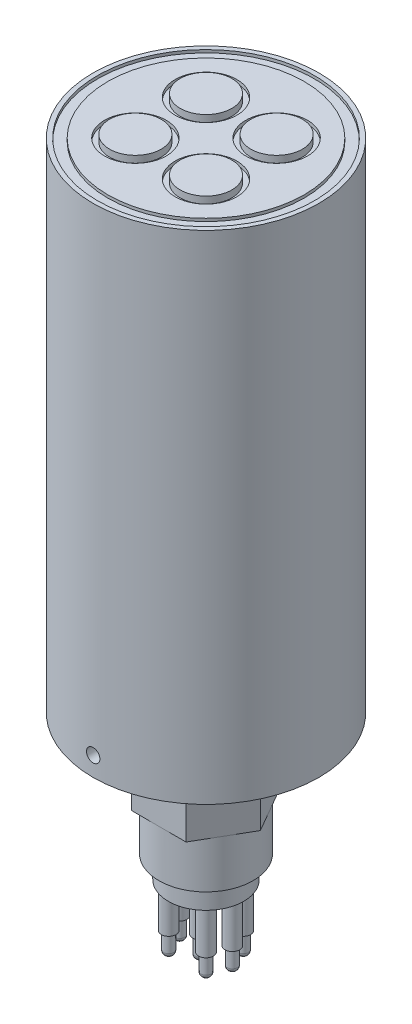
ISO-10303-21;
HEADER;
FILE_DESCRIPTION(('STEP AP214'),'2;1');
FILE_NAME('part.step','',(''),(''),'','','');
FILE_SCHEMA(('AUTOMOTIVE_DESIGN { 1 0 10303 214 1 1 1 1 }'));
ENDSEC;
DATA;
#1=APPLICATION_CONTEXT('core data for automotive mechanical design processes');
#2=APPLICATION_PROTOCOL_DEFINITION('international standard','automotive_design',2000,#1);
#3=PRODUCT_CONTEXT('',#1,'mechanical');
#4=PRODUCT('Part','Part','',(#3));
#5=PRODUCT_RELATED_PRODUCT_CATEGORY('part','',(#4));
#6=PRODUCT_DEFINITION_FORMATION('','',#4);
#7=PRODUCT_DEFINITION_CONTEXT('part definition',#1,'design');
#8=PRODUCT_DEFINITION('design','',#6,#7);
#9=PRODUCT_DEFINITION_SHAPE('','',#8);
#10=(LENGTH_UNIT() NAMED_UNIT(*) SI_UNIT(.MILLI.,.METRE.));
#11=(NAMED_UNIT(*) PLANE_ANGLE_UNIT() SI_UNIT($,.RADIAN.));
#12=(NAMED_UNIT(*) SI_UNIT($,.STERADIAN.) SOLID_ANGLE_UNIT());
#13=UNCERTAINTY_MEASURE_WITH_UNIT(LENGTH_MEASURE(1.E-05),#10,'distance_accuracy_value','');
#14=(GEOMETRIC_REPRESENTATION_CONTEXT(3) GLOBAL_UNCERTAINTY_ASSIGNED_CONTEXT((#13)) GLOBAL_UNIT_ASSIGNED_CONTEXT((#10,
#11,#12)) REPRESENTATION_CONTEXT('',''));
#15=CARTESIAN_POINT('',(0.,0.,0.));
#16=DIRECTION('',(0.,0.,1.));
#17=DIRECTION('',(1.,0.,0.));
#18=AXIS2_PLACEMENT_3D('',#15,#16,#17);
#19=CARTESIAN_POINT('',(0.,-29.337,0.));
#20=DIRECTION('',(0.,-1.,0.));
#21=DIRECTION('',(0.,0.,-1.));
#22=AXIS2_PLACEMENT_3D('',#19,#20,#21);
#23=PLANE('',#22);
#24=CARTESIAN_POINT('',(-3.771707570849,-29.337,3.77170757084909));
#25=DIRECTION('',(0.,-1.,0.));
#26=DIRECTION('',(1.,0.,0.));
#27=AXIS2_PLACEMENT_3D('',#24,#25,#26);
#28=CIRCLE('',#27,1.4859);
#29=CARTESIAN_POINT('',(-2.285807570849,-29.337,3.77170757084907));
#30=VERTEX_POINT('',#29);
#31=EDGE_CURVE('E164',#30,#30,#28,.T.);
#32=ORIENTED_EDGE('',*,*,#31,.F.);
#33=EDGE_LOOP('',(#32));
#34=FACE_BOUND('',#33,.T.);
#35=CARTESIAN_POINT('',(-3.77170757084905,-29.337,-3.77170757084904));
#36=DIRECTION('',(0.,-1.,0.));
#37=DIRECTION('',(0.,0.,1.));
#38=AXIS2_PLACEMENT_3D('',#35,#36,#37);
#39=CIRCLE('',#38,1.4859);
#40=CARTESIAN_POINT('',(-3.77170757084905,-29.337,-2.28580757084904));
#41=VERTEX_POINT('',#40);
#42=EDGE_CURVE('E174',#41,#41,#39,.T.);
#43=ORIENTED_EDGE('',*,*,#42,.F.);
#44=EDGE_LOOP('',(#43));
#45=FACE_BOUND('',#44,.T.);
#46=CARTESIAN_POINT('',(3.77170757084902,-29.337,-3.77170757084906));
#47=DIRECTION('',(0.,-1.,0.));
#48=DIRECTION('',(-1.,0.,0.));
#49=AXIS2_PLACEMENT_3D('',#46,#47,#48);
#50=CIRCLE('',#49,1.4859);
#51=CARTESIAN_POINT('',(2.28580757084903,-29.337,-3.77170757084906));
#52=VERTEX_POINT('',#51);
#53=EDGE_CURVE('E186',#52,#52,#50,.T.);
#54=ORIENTED_EDGE('',*,*,#53,.F.);
#55=EDGE_LOOP('',(#54));
#56=FACE_BOUND('',#55,.T.);
#57=CARTESIAN_POINT('',(3.77170757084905,-29.337,3.77170757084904));
#58=DIRECTION('',(0.,-1.,0.));
#59=DIRECTION('',(0.,0.,-1.));
#60=AXIS2_PLACEMENT_3D('',#57,#58,#59);
#61=CIRCLE('',#60,1.4859);
#62=CARTESIAN_POINT('',(3.77170757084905,-29.337,2.28580757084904));
#63=VERTEX_POINT('',#62);
#64=EDGE_CURVE('E203',#63,#63,#61,.T.);
#65=ORIENTED_EDGE('',*,*,#64,.F.);
#66=EDGE_LOOP('',(#65));
#67=FACE_BOUND('',#66,.T.);
#68=CARTESIAN_POINT('',(0.,-29.337,0.));
#69=DIRECTION('',(0.,-1.,0.));
#70=DIRECTION('',(0.,0.,-1.));
#71=AXIS2_PLACEMENT_3D('',#68,#69,#70);
#72=CIRCLE('',#71,7.62);
#73=CARTESIAN_POINT('',(0.,-29.337,-7.62));
#74=VERTEX_POINT('',#73);
#75=EDGE_CURVE('E210',#74,#74,#72,.T.);
#76=ORIENTED_EDGE('',*,*,#75,.T.);
#77=EDGE_LOOP('',(#76));
#78=FACE_BOUND('',#77,.T.);
#79=CARTESIAN_POINT('',(5.334,-29.337,0.));
#80=DIRECTION('',(0.,-1.,0.));
#81=DIRECTION('',(-0.707106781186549,0.,-0.707106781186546));
#82=AXIS2_PLACEMENT_3D('',#79,#80,#81);
#83=CIRCLE('',#82,1.4859);
#84=CARTESIAN_POINT('',(4.28331003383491,-29.337,-1.05068996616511));
#85=VERTEX_POINT('',#84);
#86=EDGE_CURVE('E192',#85,#85,#83,.T.);
#87=ORIENTED_EDGE('',*,*,#86,.F.);
#88=EDGE_LOOP('',(#87));
#89=FACE_BOUND('',#88,.T.);
#90=CARTESIAN_POINT('',(0.,-29.337,-5.334));
#91=DIRECTION('',(0.,-1.,0.));
#92=DIRECTION('',(-0.707106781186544,0.,0.707106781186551));
#93=AXIS2_PLACEMENT_3D('',#90,#91,#92);
#94=CIRCLE('',#93,1.4859);
#95=CARTESIAN_POINT('',(-1.05068996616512,-29.337,-4.2833100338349));
#96=VERTEX_POINT('',#95);
#97=EDGE_CURVE('E180',#96,#96,#94,.T.);
#98=ORIENTED_EDGE('',*,*,#97,.F.);
#99=EDGE_LOOP('',(#98));
#100=FACE_BOUND('',#99,.T.);
#101=CARTESIAN_POINT('',(-5.334,-29.337,0.));
#102=DIRECTION('',(0.,-1.,0.));
#103=DIRECTION('',(0.707106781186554,0.,0.707106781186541));
#104=AXIS2_PLACEMENT_3D('',#101,#102,#103);
#105=CIRCLE('',#104,1.4859);
#106=CARTESIAN_POINT('',(-4.2833100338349,-29.337,1.05068996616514));
#107=VERTEX_POINT('',#106);
#108=EDGE_CURVE('E168',#107,#107,#105,.T.);
#109=ORIENTED_EDGE('',*,*,#108,.F.);
#110=EDGE_LOOP('',(#109));
#111=FACE_BOUND('',#110,.T.);
#112=CARTESIAN_POINT('',(-0.000192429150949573,-29.337,1.23170757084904));
#113=DIRECTION('',(0.,-1.,0.));
#114=DIRECTION('',(0.,0.,-1.));
#115=AXIS2_PLACEMENT_3D('',#112,#113,#114);
#116=CIRCLE('',#115,1.4859);
#117=CARTESIAN_POINT('',(-0.000192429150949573,-29.337,-0.25419242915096));
#118=VERTEX_POINT('',#117);
#119=EDGE_CURVE('E129',#118,#118,#116,.T.);
#120=ORIENTED_EDGE('',*,*,#119,.F.);
#121=EDGE_LOOP('',(#120));
#122=FACE_BOUND('',#121,.T.);
#123=ADVANCED_FACE('F37',(#34,#45,#56,#67,#78,#89,#100,#111,#122),#23,.T.);
#124=CARTESIAN_POINT('',(-3.771707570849,-38.227,3.77170757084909));
#125=DIRECTION('',(0.,-1.,0.));
#126=DIRECTION('',(1.,0.,0.));
#127=AXIS2_PLACEMENT_3D('',#124,#125,#126);
#128=PLANE('',#127);
#129=CARTESIAN_POINT('',(-3.771707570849,-38.227,3.77170757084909));
#130=DIRECTION('',(0.,-1.,0.));
#131=DIRECTION('',(1.,0.,0.));
#132=AXIS2_PLACEMENT_3D('',#129,#130,#131);
#133=CIRCLE('',#132,1.4859);
#134=CARTESIAN_POINT('',(-2.285807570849,-38.227,3.77170757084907));
#135=VERTEX_POINT('',#134);
#136=EDGE_CURVE('E165',#135,#135,#133,.T.);
#137=ORIENTED_EDGE('',*,*,#136,.T.);
#138=EDGE_LOOP('',(#137));
#139=FACE_BOUND('',#138,.T.);
#140=CARTESIAN_POINT('',(-3.771707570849,-38.227,3.77170757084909));
#141=DIRECTION('',(0.,-1.,0.));
#142=DIRECTION('',(1.,0.,0.));
#143=AXIS2_PLACEMENT_3D('',#140,#141,#142);
#144=CIRCLE('',#143,1.016);
#145=CARTESIAN_POINT('',(-2.755707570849,-38.227,3.77170757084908));
#146=VERTEX_POINT('',#145);
#147=EDGE_CURVE('E146',#146,#146,#144,.T.);
#148=ORIENTED_EDGE('',*,*,#147,.F.);
#149=EDGE_LOOP('',(#148));
#150=FACE_BOUND('',#149,.T.);
#151=ADVANCED_FACE('F473',(#139,#150),#128,.T.);
#152=CARTESIAN_POINT('',(-5.334,-38.227,0.));
#153=DIRECTION('',(0.,-1.,0.));
#154=DIRECTION('',(0.707106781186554,0.,0.707106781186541));
#155=AXIS2_PLACEMENT_3D('',#152,#153,#154);
#156=PLANE('',#155);
#157=CARTESIAN_POINT('',(-5.334,-38.227,0.));
#158=DIRECTION('',(0.,-1.,0.));
#159=DIRECTION('',(0.707106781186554,0.,0.707106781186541));
#160=AXIS2_PLACEMENT_3D('',#157,#158,#159);
#161=CIRCLE('',#160,1.4859);
#162=CARTESIAN_POINT('',(-4.2833100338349,-38.227,1.05068996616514));
#163=VERTEX_POINT('',#162);
#164=EDGE_CURVE('E171',#163,#163,#161,.T.);
#165=ORIENTED_EDGE('',*,*,#164,.T.);
#166=EDGE_LOOP('',(#165));
#167=FACE_BOUND('',#166,.T.);
#168=CARTESIAN_POINT('',(-5.334,-38.227,0.));
#169=DIRECTION('',(0.,-1.,0.));
#170=DIRECTION('',(0.707106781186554,0.,0.707106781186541));
#171=AXIS2_PLACEMENT_3D('',#168,#169,#170);
#172=CIRCLE('',#171,1.016);
#173=CARTESIAN_POINT('',(-4.61557951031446,-38.227,0.718420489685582));
#174=VERTEX_POINT('',#173);
#175=EDGE_CURVE('E149',#174,#174,#172,.T.);
#176=ORIENTED_EDGE('',*,*,#175,.F.);
#177=EDGE_LOOP('',(#176));
#178=FACE_BOUND('',#177,.T.);
#179=ADVANCED_FACE('F476',(#167,#178),#156,.T.);
#180=CARTESIAN_POINT('',(-3.77170757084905,-38.227,-3.77170757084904));
#181=DIRECTION('',(0.,-1.,0.));
#182=DIRECTION('',(0.,0.,1.));
#183=AXIS2_PLACEMENT_3D('',#180,#181,#182);
#184=PLANE('',#183);
#185=CARTESIAN_POINT('',(-3.77170757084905,-38.227,-3.77170757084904));
#186=DIRECTION('',(0.,-1.,0.));
#187=DIRECTION('',(0.,0.,1.));
#188=AXIS2_PLACEMENT_3D('',#185,#186,#187);
#189=CIRCLE('',#188,1.4859);
#190=CARTESIAN_POINT('',(-3.77170757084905,-38.227,-2.28580757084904));
#191=VERTEX_POINT('',#190);
#192=EDGE_CURVE('E177',#191,#191,#189,.T.);
#193=ORIENTED_EDGE('',*,*,#192,.T.);
#194=EDGE_LOOP('',(#193));
#195=FACE_BOUND('',#194,.T.);
#196=CARTESIAN_POINT('',(-3.77170757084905,-38.227,-3.77170757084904));
#197=DIRECTION('',(0.,-1.,0.));
#198=DIRECTION('',(0.,0.,1.));
#199=AXIS2_PLACEMENT_3D('',#196,#197,#198);
#200=CIRCLE('',#199,1.016);
#201=CARTESIAN_POINT('',(-3.77170757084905,-38.227,-2.75570757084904));
#202=VERTEX_POINT('',#201);
#203=EDGE_CURVE('E152',#202,#202,#200,.T.);
#204=ORIENTED_EDGE('',*,*,#203,.F.);
#205=EDGE_LOOP('',(#204));
#206=FACE_BOUND('',#205,.T.);
#207=ADVANCED_FACE('F484',(#195,#206),#184,.T.);
#208=CARTESIAN_POINT('',(0.,-38.227,-5.334));
#209=DIRECTION('',(0.,-1.,0.));
#210=DIRECTION('',(-0.707106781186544,0.,0.707106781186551));
#211=AXIS2_PLACEMENT_3D('',#208,#209,#210);
#212=PLANE('',#211);
#213=CARTESIAN_POINT('',(0.,-38.227,-5.334));
#214=DIRECTION('',(0.,-1.,0.));
#215=DIRECTION('',(-0.707106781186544,0.,0.707106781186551));
#216=AXIS2_PLACEMENT_3D('',#213,#214,#215);
#217=CIRCLE('',#216,1.4859);
#218=CARTESIAN_POINT('',(-1.05068996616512,-38.227,-4.2833100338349));
#219=VERTEX_POINT('',#218);
#220=EDGE_CURVE('E183',#219,#219,#217,.T.);
#221=ORIENTED_EDGE('',*,*,#220,.T.);
#222=EDGE_LOOP('',(#221));
#223=FACE_BOUND('',#222,.T.);
#224=CARTESIAN_POINT('',(0.,-38.227,-5.334));
#225=DIRECTION('',(0.,-1.,0.));
#226=DIRECTION('',(-0.707106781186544,0.,0.707106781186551));
#227=AXIS2_PLACEMENT_3D('',#224,#225,#226);
#228=CIRCLE('',#227,1.016);
#229=CARTESIAN_POINT('',(-0.718420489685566,-38.227,-4.61557951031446));
#230=VERTEX_POINT('',#229);
#231=EDGE_CURVE('E155',#230,#230,#228,.T.);
#232=ORIENTED_EDGE('',*,*,#231,.F.);
#233=EDGE_LOOP('',(#232));
#234=FACE_BOUND('',#233,.T.);
#235=ADVANCED_FACE('F492',(#223,#234),#212,.T.);
#236=CARTESIAN_POINT('',(3.77170757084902,-38.227,-3.77170757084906));
#237=DIRECTION('',(0.,-1.,0.));
#238=DIRECTION('',(-1.,0.,0.));
#239=AXIS2_PLACEMENT_3D('',#236,#237,#238);
#240=PLANE('',#239);
#241=CARTESIAN_POINT('',(3.77170757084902,-38.227,-3.77170757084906));
#242=DIRECTION('',(0.,-1.,0.));
#243=DIRECTION('',(-1.,0.,0.));
#244=AXIS2_PLACEMENT_3D('',#241,#242,#243);
#245=CIRCLE('',#244,1.4859);
#246=CARTESIAN_POINT('',(2.28580757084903,-38.227,-3.77170757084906));
#247=VERTEX_POINT('',#246);
#248=EDGE_CURVE('E189',#247,#247,#245,.T.);
#249=ORIENTED_EDGE('',*,*,#248,.T.);
#250=EDGE_LOOP('',(#249));
#251=FACE_BOUND('',#250,.T.);
#252=CARTESIAN_POINT('',(3.77170757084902,-38.227,-3.77170757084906));
#253=DIRECTION('',(0.,-1.,0.));
#254=DIRECTION('',(-1.,0.,0.));
#255=AXIS2_PLACEMENT_3D('',#252,#253,#254);
#256=CIRCLE('',#255,1.016);
#257=CARTESIAN_POINT('',(2.75570757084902,-38.227,-3.77170757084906));
#258=VERTEX_POINT('',#257);
#259=EDGE_CURVE('E158',#258,#258,#256,.T.);
#260=ORIENTED_EDGE('',*,*,#259,.F.);
#261=EDGE_LOOP('',(#260));
#262=FACE_BOUND('',#261,.T.);
#263=ADVANCED_FACE('F500',(#251,#262),#240,.T.);
#264=CARTESIAN_POINT('',(5.334,-38.227,0.));
#265=DIRECTION('',(0.,-1.,0.));
#266=DIRECTION('',(-0.707106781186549,0.,-0.707106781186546));
#267=AXIS2_PLACEMENT_3D('',#264,#265,#266);
#268=PLANE('',#267);
#269=CARTESIAN_POINT('',(5.334,-38.227,0.));
#270=DIRECTION('',(0.,-1.,0.));
#271=DIRECTION('',(-0.707106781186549,0.,-0.707106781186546));
#272=AXIS2_PLACEMENT_3D('',#269,#270,#271);
#273=CIRCLE('',#272,1.4859);
#274=CARTESIAN_POINT('',(4.28331003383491,-38.227,-1.05068996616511));
#275=VERTEX_POINT('',#274);
#276=EDGE_CURVE('E195',#275,#275,#273,.T.);
#277=ORIENTED_EDGE('',*,*,#276,.T.);
#278=EDGE_LOOP('',(#277));
#279=FACE_BOUND('',#278,.T.);
#280=CARTESIAN_POINT('',(5.334,-38.227,0.));
#281=DIRECTION('',(0.,-1.,0.));
#282=DIRECTION('',(-0.707106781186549,0.,-0.707106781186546));
#283=AXIS2_PLACEMENT_3D('',#280,#281,#282);
#284=CIRCLE('',#283,1.016);
#285=CARTESIAN_POINT('',(4.61557951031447,-38.227,-0.718420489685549));
#286=VERTEX_POINT('',#285);
#287=EDGE_CURVE('E161',#286,#286,#284,.T.);
#288=ORIENTED_EDGE('',*,*,#287,.F.);
#289=EDGE_LOOP('',(#288));
#290=FACE_BOUND('',#289,.T.);
#291=ADVANCED_FACE('F508',(#279,#290),#268,.T.);
#292=CARTESIAN_POINT('',(3.77170757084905,-38.227,3.77170757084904));
#293=DIRECTION('',(0.,-1.,0.));
#294=DIRECTION('',(0.,0.,-1.));
#295=AXIS2_PLACEMENT_3D('',#292,#293,#294);
#296=PLANE('',#295);
#297=CARTESIAN_POINT('',(3.77170757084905,-38.227,3.77170757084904));
#298=DIRECTION('',(0.,-1.,0.));
#299=DIRECTION('',(0.,0.,-1.));
#300=AXIS2_PLACEMENT_3D('',#297,#298,#299);
#301=CIRCLE('',#300,1.4859);
#302=CARTESIAN_POINT('',(3.77170757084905,-38.227,2.28580757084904));
#303=VERTEX_POINT('',#302);
#304=EDGE_CURVE('E204',#303,#303,#301,.T.);
#305=ORIENTED_EDGE('',*,*,#304,.T.);
#306=EDGE_LOOP('',(#305));
#307=FACE_BOUND('',#306,.T.);
#308=CARTESIAN_POINT('',(3.77170757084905,-38.227,3.77170757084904));
#309=DIRECTION('',(0.,-1.,0.));
#310=DIRECTION('',(0.,0.,-1.));
#311=AXIS2_PLACEMENT_3D('',#308,#309,#310);
#312=CIRCLE('',#311,1.016);
#313=CARTESIAN_POINT('',(3.77170757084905,-38.227,2.75570757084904));
#314=VERTEX_POINT('',#313);
#315=EDGE_CURVE('E198',#314,#314,#312,.T.);
#316=ORIENTED_EDGE('',*,*,#315,.F.);
#317=EDGE_LOOP('',(#316));
#318=FACE_BOUND('',#317,.T.);
#319=ADVANCED_FACE('F516',(#307,#318),#296,.T.);
#320=CARTESIAN_POINT('',(0.,-24.765,0.));
#321=DIRECTION('',(0.,-1.,0.));
#322=DIRECTION('',(0.,0.,-1.));
#323=AXIS2_PLACEMENT_3D('',#320,#321,#322);
#324=PLANE('',#323);
#325=CARTESIAN_POINT('',(0.,-24.765,0.));
#326=DIRECTION('',(0.,-1.,0.));
#327=DIRECTION('',(0.,0.,-1.));
#328=AXIS2_PLACEMENT_3D('',#325,#326,#327);
#329=CIRCLE('',#328,9.525);
#330=CARTESIAN_POINT('',(0.,-24.765,-9.525));
#331=VERTEX_POINT('',#330);
#332=EDGE_CURVE('E216',#331,#331,#329,.T.);
#333=ORIENTED_EDGE('',*,*,#332,.T.);
#334=EDGE_LOOP('',(#333));
#335=FACE_BOUND('',#334,.T.);
#336=CARTESIAN_POINT('',(0.,-24.765,0.));
#337=DIRECTION('',(0.,-1.,0.));
#338=DIRECTION('',(0.,0.,-1.));
#339=AXIS2_PLACEMENT_3D('',#336,#337,#338);
#340=CIRCLE('',#339,7.62);
#341=CARTESIAN_POINT('',(0.,-24.765,-7.62));
#342=VERTEX_POINT('',#341);
#343=EDGE_CURVE('E207',#342,#342,#340,.T.);
#344=ORIENTED_EDGE('',*,*,#343,.F.);
#345=EDGE_LOOP('',(#344));
#346=FACE_BOUND('',#345,.T.);
#347=ADVANCED_FACE('F533',(#335,#346),#324,.T.);
#348=CARTESIAN_POINT('',(0.,-15.24,0.));
#349=DIRECTION('',(0.,-1.,0.));
#350=DIRECTION('',(0.,0.,-1.));
#351=AXIS2_PLACEMENT_3D('',#348,#349,#350);
#352=PLANE('',#351);
#353=CARTESIAN_POINT('',(0.,-15.24,0.));
#354=DIRECTION('',(0.,-1.,0.));
#355=DIRECTION('',(0.,0.,-1.));
#356=AXIS2_PLACEMENT_3D('',#353,#354,#355);
#357=CIRCLE('',#356,9.525);
#358=CARTESIAN_POINT('',(0.,-15.24,-9.525));
#359=VERTEX_POINT('',#358);
#360=CARTESIAN_POINT('',(8.24889197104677,-15.24,-4.7625));
#361=VERTEX_POINT('',#360);
#362=EDGE_CURVE('E213',#359,#361,#357,.T.);
#363=ORIENTED_EDGE('',*,*,#362,.F.);
#364=DIRECTION('',(1.,0.,0.));
#365=VECTOR('',#364,1.);
#366=CARTESIAN_POINT('',(-5.49926131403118,-15.24,-9.525));
#367=LINE('',#366,#365);
#368=CARTESIAN_POINT('',(5.49926131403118,-15.24,-9.525));
#369=VERTEX_POINT('',#368);
#370=EDGE_CURVE('E237',#359,#369,#367,.T.);
#371=ORIENTED_EDGE('',*,*,#370,.T.);
#372=DIRECTION('',(0.5,0.,0.866025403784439));
#373=VECTOR('',#372,1.);
#374=CARTESIAN_POINT('',(5.49926131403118,-15.24,-9.525));
#375=LINE('',#374,#373);
#376=EDGE_CURVE('E241',#369,#361,#375,.T.);
#377=ORIENTED_EDGE('',*,*,#376,.T.);
#378=EDGE_LOOP('',(#363,#371,#377));
#379=FACE_BOUND('',#378,.T.);
#380=ADVANCED_FACE('F548',(#379),#352,.T.);
#381=CARTESIAN_POINT('',(8.24889197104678,-15.24,4.7625));
#382=VERTEX_POINT('',#381);
#383=EDGE_CURVE('E56',#361,#382,#357,.T.);
#384=ORIENTED_EDGE('',*,*,#383,.F.);
#385=CARTESIAN_POINT('',(10.9985226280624,-15.24,0.));
#386=VERTEX_POINT('',#385);
#387=EDGE_CURVE('E240',#361,#386,#375,.T.);
#388=ORIENTED_EDGE('',*,*,#387,.T.);
#389=DIRECTION('',(-0.5,0.,0.866025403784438));
#390=VECTOR('',#389,1.);
#391=CARTESIAN_POINT('',(10.9985226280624,-15.24,0.));
#392=LINE('',#391,#390);
#393=EDGE_CURVE('E222',#386,#382,#392,.T.);
#394=ORIENTED_EDGE('',*,*,#393,.T.);
#395=EDGE_LOOP('',(#384,#388,#394));
#396=FACE_BOUND('',#395,.T.);
#397=ADVANCED_FACE('F677',(#396),#352,.T.);
#398=CARTESIAN_POINT('',(0.,-15.24,9.525));
#399=VERTEX_POINT('',#398);
#400=EDGE_CURVE('E681',#382,#399,#357,.T.);
#401=ORIENTED_EDGE('',*,*,#400,.F.);
#402=CARTESIAN_POINT('',(5.49926131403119,-15.24,9.525));
#403=VERTEX_POINT('',#402);
#404=EDGE_CURVE('E225',#382,#403,#392,.T.);
#405=ORIENTED_EDGE('',*,*,#404,.T.);
#406=DIRECTION('',(-1.,0.,0.));
#407=VECTOR('',#406,1.);
#408=CARTESIAN_POINT('',(5.49926131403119,-15.24,9.525));
#409=LINE('',#408,#407);
#410=EDGE_CURVE('E226',#403,#399,#409,.T.);
#411=ORIENTED_EDGE('',*,*,#410,.T.);
#412=EDGE_LOOP('',(#401,#405,#411));
#413=FACE_BOUND('',#412,.T.);
#414=ADVANCED_FACE('F702',(#413),#352,.T.);
#415=CARTESIAN_POINT('',(-8.24889197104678,-15.24,4.7625));
#416=VERTEX_POINT('',#415);
#417=EDGE_CURVE('E683',#399,#416,#357,.T.);
#418=ORIENTED_EDGE('',*,*,#417,.F.);
#419=CARTESIAN_POINT('',(-5.49926131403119,-15.24,9.525));
#420=VERTEX_POINT('',#419);
#421=EDGE_CURVE('E224',#399,#420,#409,.T.);
#422=ORIENTED_EDGE('',*,*,#421,.T.);
#423=DIRECTION('',(-0.5,0.,-0.866025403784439));
#424=VECTOR('',#423,1.);
#425=CARTESIAN_POINT('',(-5.49926131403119,-15.24,9.525));
#426=LINE('',#425,#424);
#427=EDGE_CURVE('E230',#420,#416,#426,.T.);
#428=ORIENTED_EDGE('',*,*,#427,.T.);
#429=EDGE_LOOP('',(#418,#422,#428));
#430=FACE_BOUND('',#429,.T.);
#431=ADVANCED_FACE('F667',(#430),#352,.T.);
#432=CARTESIAN_POINT('',(-8.24889197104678,-15.24,-4.7625));
#433=VERTEX_POINT('',#432);
#434=EDGE_CURVE('E684',#416,#433,#357,.T.);
#435=ORIENTED_EDGE('',*,*,#434,.F.);
#436=CARTESIAN_POINT('',(-10.9985226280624,-15.24,0.));
#437=VERTEX_POINT('',#436);
#438=EDGE_CURVE('E229',#416,#437,#426,.T.);
#439=ORIENTED_EDGE('',*,*,#438,.T.);
#440=DIRECTION('',(0.5,0.,-0.866025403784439));
#441=VECTOR('',#440,1.);
#442=CARTESIAN_POINT('',(-10.9985226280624,-15.24,0.));
#443=LINE('',#442,#441);
#444=EDGE_CURVE('E234',#437,#433,#443,.T.);
#445=ORIENTED_EDGE('',*,*,#444,.T.);
#446=EDGE_LOOP('',(#435,#439,#445));
#447=FACE_BOUND('',#446,.T.);
#448=ADVANCED_FACE('F557',(#447),#352,.T.);
#449=CARTESIAN_POINT('',(0.,0.,0.));
#450=DIRECTION('',(0.,1.,0.));
#451=DIRECTION('',(0.,0.,1.));
#452=AXIS2_PLACEMENT_3D('',#449,#450,#451);
#453=PLANE('',#452);
#454=CARTESIAN_POINT('',(0.,0.,0.));
#455=DIRECTION('',(0.,1.,0.));
#456=DIRECTION('',(0.,0.,1.));
#457=AXIS2_PLACEMENT_3D('',#454,#455,#456);
#458=CIRCLE('',#457,22.86);
#459=CARTESIAN_POINT('',(0.,0.,22.86));
#460=VERTEX_POINT('',#459);
#461=EDGE_CURVE('E331',#460,#460,#458,.T.);
#462=ORIENTED_EDGE('',*,*,#461,.F.);
#463=EDGE_LOOP('',(#462));
#464=FACE_BOUND('',#463,.T.);
#465=DIRECTION('',(-0.5,0.,0.866025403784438));
#466=VECTOR('',#465,1.);
#467=CARTESIAN_POINT('',(10.9985226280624,0.,0.));
#468=LINE('',#467,#466);
#469=CARTESIAN_POINT('',(10.9985226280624,0.,0.));
#470=VERTEX_POINT('',#469);
#471=CARTESIAN_POINT('',(5.49926131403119,0.,9.525));
#472=VERTEX_POINT('',#471);
#473=EDGE_CURVE('E219',#470,#472,#468,.T.);
#474=ORIENTED_EDGE('',*,*,#473,.F.);
#475=DIRECTION('',(0.5,0.,0.866025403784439));
#476=VECTOR('',#475,1.);
#477=CARTESIAN_POINT('',(5.49926131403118,0.,-9.525));
#478=LINE('',#477,#476);
#479=CARTESIAN_POINT('',(5.49926131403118,0.,-9.525));
#480=VERTEX_POINT('',#479);
#481=EDGE_CURVE('E259',#480,#470,#478,.T.);
#482=ORIENTED_EDGE('',*,*,#481,.F.);
#483=DIRECTION('',(1.,0.,0.));
#484=VECTOR('',#483,1.);
#485=CARTESIAN_POINT('',(-5.49926131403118,0.,-9.525));
#486=LINE('',#485,#484);
#487=CARTESIAN_POINT('',(-5.49926131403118,0.,-9.525));
#488=VERTEX_POINT('',#487);
#489=EDGE_CURVE('E256',#488,#480,#486,.T.);
#490=ORIENTED_EDGE('',*,*,#489,.F.);
#491=DIRECTION('',(0.5,0.,-0.866025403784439));
#492=VECTOR('',#491,1.);
#493=CARTESIAN_POINT('',(-10.9985226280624,0.,0.));
#494=LINE('',#493,#492);
#495=CARTESIAN_POINT('',(-10.9985226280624,0.,0.));
#496=VERTEX_POINT('',#495);
#497=EDGE_CURVE('E253',#496,#488,#494,.T.);
#498=ORIENTED_EDGE('',*,*,#497,.F.);
#499=DIRECTION('',(-0.5,0.,-0.866025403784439));
#500=VECTOR('',#499,1.);
#501=CARTESIAN_POINT('',(-5.49926131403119,0.,9.525));
#502=LINE('',#501,#500);
#503=CARTESIAN_POINT('',(-5.49926131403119,0.,9.525));
#504=VERTEX_POINT('',#503);
#505=EDGE_CURVE('E250',#504,#496,#502,.T.);
#506=ORIENTED_EDGE('',*,*,#505,.F.);
#507=DIRECTION('',(-1.,0.,0.));
#508=VECTOR('',#507,1.);
#509=CARTESIAN_POINT('',(5.49926131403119,0.,9.525));
#510=LINE('',#509,#508);
#511=EDGE_CURVE('E247',#472,#504,#510,.T.);
#512=ORIENTED_EDGE('',*,*,#511,.F.);
#513=EDGE_LOOP('',(#474,#482,#490,#498,#506,#512));
#514=FACE_BOUND('',#513,.T.);
#515=ADVANCED_FACE('F618',(#464,#514),#453,.F.);
#516=CARTESIAN_POINT('',(-7.14375,99.8728,7.14375));
#517=DIRECTION('',(0.,-1.,0.));
#518=DIRECTION('',(0.,0.,-1.));
#519=AXIS2_PLACEMENT_3D('',#516,#517,#518);
#520=PLANE('',#519);
#521=CARTESIAN_POINT('',(-7.14375,99.8728,7.14375));
#522=DIRECTION('',(0.,1.,0.));
#523=DIRECTION('',(0.,0.,-1.));
#524=AXIS2_PLACEMENT_3D('',#521,#522,#523);
#525=CIRCLE('',#524,6.25475);
#526=CARTESIAN_POINT('',(-7.14375,99.8728,0.888999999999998));
#527=VERTEX_POINT('',#526);
#528=EDGE_CURVE('E298',#527,#527,#525,.T.);
#529=ORIENTED_EDGE('',*,*,#528,.T.);
#530=EDGE_LOOP('',(#529));
#531=FACE_BOUND('',#530,.T.);
#532=CARTESIAN_POINT('',(-7.14375,99.8728,7.14375));
#533=DIRECTION('',(0.,-1.,0.));
#534=DIRECTION('',(0.,0.,-1.));
#535=AXIS2_PLACEMENT_3D('',#532,#533,#534);
#536=CIRCLE('',#535,5.2324);
#537=CARTESIAN_POINT('',(-7.14375,99.8728,1.91135));
#538=VERTEX_POINT('',#537);
#539=EDGE_CURVE('E342',#538,#538,#536,.F.);
#540=ORIENTED_EDGE('',*,*,#539,.F.);
#541=EDGE_LOOP('',(#540));
#542=FACE_BOUND('',#541,.T.);
#543=ADVANCED_FACE('F614',(#531,#542),#520,.F.);
#544=CARTESIAN_POINT('',(7.14375,99.8728,7.14375));
#545=DIRECTION('',(0.,1.,0.));
#546=DIRECTION('',(0.,0.,1.));
#547=AXIS2_PLACEMENT_3D('',#544,#545,#546);
#548=PLANE('',#547);
#549=CARTESIAN_POINT('',(7.14375,99.8728,7.14375));
#550=DIRECTION('',(0.,1.,0.));
#551=DIRECTION('',(0.,0.,1.));
#552=AXIS2_PLACEMENT_3D('',#549,#550,#551);
#553=CIRCLE('',#552,6.25475);
#554=CARTESIAN_POINT('',(7.14375,99.8728,13.3985));
#555=VERTEX_POINT('',#554);
#556=EDGE_CURVE('E304',#555,#555,#553,.T.);
#557=ORIENTED_EDGE('',*,*,#556,.T.);
#558=EDGE_LOOP('',(#557));
#559=FACE_BOUND('',#558,.T.);
#560=CARTESIAN_POINT('',(7.14375,99.8728,7.14375));
#561=DIRECTION('',(0.,1.,0.));
#562=DIRECTION('',(0.,0.,1.));
#563=AXIS2_PLACEMENT_3D('',#560,#561,#562);
#564=CIRCLE('',#563,5.2324);
#565=CARTESIAN_POINT('',(7.14375,99.8728,12.37615));
#566=VERTEX_POINT('',#565);
#567=EDGE_CURVE('E282',#566,#566,#564,.T.);
#568=ORIENTED_EDGE('',*,*,#567,.F.);
#569=EDGE_LOOP('',(#568));
#570=FACE_BOUND('',#569,.T.);
#571=ADVANCED_FACE('F617',(#559,#570),#548,.T.);
#572=CARTESIAN_POINT('',(7.14375,99.8728,-7.14375));
#573=DIRECTION('',(0.,-1.,0.));
#574=DIRECTION('',(0.,0.,-1.));
#575=AXIS2_PLACEMENT_3D('',#572,#573,#574);
#576=PLANE('',#575);
#577=CARTESIAN_POINT('',(7.14375,99.8728,-7.14375));
#578=DIRECTION('',(0.,1.,0.));
#579=DIRECTION('',(0.,0.,-1.));
#580=AXIS2_PLACEMENT_3D('',#577,#578,#579);
#581=CIRCLE('',#580,6.25475);
#582=CARTESIAN_POINT('',(7.14375,99.8728,-13.3985));
#583=VERTEX_POINT('',#582);
#584=EDGE_CURVE('E310',#583,#583,#581,.T.);
#585=ORIENTED_EDGE('',*,*,#584,.T.);
#586=EDGE_LOOP('',(#585));
#587=FACE_BOUND('',#586,.T.);
#588=CARTESIAN_POINT('',(7.14375,99.8728,-7.14375));
#589=DIRECTION('',(0.,-1.,0.));
#590=DIRECTION('',(0.,0.,-1.));
#591=AXIS2_PLACEMENT_3D('',#588,#589,#590);
#592=CIRCLE('',#591,5.2324);
#593=CARTESIAN_POINT('',(7.14375,99.8728,-12.37615));
#594=VERTEX_POINT('',#593);
#595=EDGE_CURVE('E337',#594,#594,#592,.F.);
#596=ORIENTED_EDGE('',*,*,#595,.F.);
#597=EDGE_LOOP('',(#596));
#598=FACE_BOUND('',#597,.T.);
#599=ADVANCED_FACE('F626',(#587,#598),#576,.F.);
#600=CARTESIAN_POINT('',(-7.14375,99.8728,-7.14375));
#601=DIRECTION('',(0.,1.,0.));
#602=DIRECTION('',(0.,0.,1.));
#603=AXIS2_PLACEMENT_3D('',#600,#601,#602);
#604=PLANE('',#603);
#605=CARTESIAN_POINT('',(-7.14375,99.8728,-7.14375));
#606=DIRECTION('',(0.,1.,0.));
#607=DIRECTION('',(0.,0.,1.));
#608=AXIS2_PLACEMENT_3D('',#605,#606,#607);
#609=CIRCLE('',#608,6.25475);
#610=CARTESIAN_POINT('',(-7.14375,99.8728,-0.888999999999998));
#611=VERTEX_POINT('',#610);
#612=EDGE_CURVE('E316',#611,#611,#609,.T.);
#613=ORIENTED_EDGE('',*,*,#612,.T.);
#614=EDGE_LOOP('',(#613));
#615=FACE_BOUND('',#614,.T.);
#616=CARTESIAN_POINT('',(-7.14375,99.8728,-7.14375));
#617=DIRECTION('',(0.,1.,0.));
#618=DIRECTION('',(0.,0.,1.));
#619=AXIS2_PLACEMENT_3D('',#616,#617,#618);
#620=CIRCLE('',#619,5.2324);
#621=CARTESIAN_POINT('',(-7.14375,99.8728,-1.91135));
#622=VERTEX_POINT('',#621);
#623=EDGE_CURVE('E291',#622,#622,#620,.T.);
#624=ORIENTED_EDGE('',*,*,#623,.F.);
#625=EDGE_LOOP('',(#624));
#626=FACE_BOUND('',#625,.T.);
#627=ADVANCED_FACE('F634',(#615,#626),#604,.T.);
#628=CARTESIAN_POINT('',(0.,100.584,0.));
#629=DIRECTION('',(0.,-1.,0.));
#630=DIRECTION('',(0.,0.,-1.));
#631=AXIS2_PLACEMENT_3D('',#628,#629,#630);
#632=CYLINDRICAL_SURFACE('',#631,22.86);
#633=CARTESIAN_POINT('',(1.35254999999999,3.9,22.8199519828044));
#634=CARTESIAN_POINT('',(1.35254665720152,3.8240980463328,22.8199525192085));
#635=CARTESIAN_POINT('',(1.34613937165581,3.74814274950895,22.8203347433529));
#636=CARTESIAN_POINT('',(1.32067109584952,3.59832890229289,22.8218225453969));
#637=CARTESIAN_POINT('',(1.30159532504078,3.52447290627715,22.8229289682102));
#638=CARTESIAN_POINT('',(1.25133941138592,3.38104945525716,22.8257394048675));
#639=CARTESIAN_POINT('',(1.22016559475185,3.31147978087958,22.8274431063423));
#640=CARTESIAN_POINT('',(1.14660858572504,3.17857900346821,22.8312557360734));
#641=CARTESIAN_POINT('',(1.10422798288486,3.11524646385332,22.8333645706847));
#642=CARTESIAN_POINT('',(1.00939694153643,2.99651312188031,22.8377531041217));
#643=CARTESIAN_POINT('',(0.956934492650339,2.94112191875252,22.8400330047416));
#644=CARTESIAN_POINT('',(0.843453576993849,2.83992567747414,22.8445048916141));
#645=CARTESIAN_POINT('',(0.782434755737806,2.79412103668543,22.8466968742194));
#646=CARTESIAN_POINT('',(0.653520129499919,2.71336951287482,22.8507476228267));
#647=CARTESIAN_POINT('',(0.585619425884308,2.67843043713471,22.8526061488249));
#648=CARTESIAN_POINT('',(0.444902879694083,2.62045185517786,22.8557784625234));
#649=CARTESIAN_POINT('',(0.372087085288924,2.59741223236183,22.8570922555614));
#650=CARTESIAN_POINT('',(0.223698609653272,2.56391283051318,22.859025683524));
#651=CARTESIAN_POINT('',(0.148129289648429,2.55343821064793,22.8596461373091));
#652=CARTESIAN_POINT('',(-0.00369736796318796,2.5453203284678,22.8601257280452));
#653=CARTESIAN_POINT('',(-0.0799546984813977,2.54767693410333,22.8599848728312));
#654=CARTESIAN_POINT('',(-0.230892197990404,2.56514234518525,22.8589584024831));
#655=CARTESIAN_POINT('',(-0.305574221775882,2.58023518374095,22.8580737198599));
#656=CARTESIAN_POINT('',(-0.451342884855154,2.62271986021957,22.8556602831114));
#657=CARTESIAN_POINT('',(-0.52242950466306,2.65011176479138,22.8541315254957));
#658=CARTESIAN_POINT('',(-0.659040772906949,2.71643513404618,22.8506004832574));
#659=CARTESIAN_POINT('',(-0.724561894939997,2.75537384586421,22.848597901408));
#660=CARTESIAN_POINT('',(-0.848143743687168,2.84368022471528,22.8443446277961));
#661=CARTESIAN_POINT('',(-0.906204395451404,2.89304799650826,22.8420939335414));
#662=CARTESIAN_POINT('',(-1.01331034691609,3.0009013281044,22.8375937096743));
#663=CARTESIAN_POINT('',(-1.06234169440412,3.05940074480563,22.8353441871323));
#664=CARTESIAN_POINT('',(-1.14988967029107,3.18380819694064,22.8311033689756));
#665=CARTESIAN_POINT('',(-1.18840629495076,3.24971623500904,22.8291120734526));
#666=CARTESIAN_POINT('',(-1.25383042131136,3.38707878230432,22.8256125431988));
#667=CARTESIAN_POINT('',(-1.28073735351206,3.45853356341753,22.8241043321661));
#668=CARTESIAN_POINT('',(-1.32216876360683,3.60495726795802,22.8217419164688));
#669=CARTESIAN_POINT('',(-1.33669337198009,3.67992615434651,22.8208877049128));
#670=CARTESIAN_POINT('',(-1.35293048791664,3.83112832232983,22.8199309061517));
#671=CARTESIAN_POINT('',(-1.35466238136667,3.90735951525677,22.8198271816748));
#672=CARTESIAN_POINT('',(-1.34531553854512,4.05902931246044,22.820380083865));
#673=CARTESIAN_POINT('',(-1.33423686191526,4.13446792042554,22.8210367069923));
#674=CARTESIAN_POINT('',(-1.29959945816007,4.28235640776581,22.8230352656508));
#675=CARTESIAN_POINT('',(-1.27604964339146,4.35480838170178,22.8243767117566));
#676=CARTESIAN_POINT('',(-1.21714748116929,4.49473156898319,22.8275933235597));
#677=CARTESIAN_POINT('',(-1.18179503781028,4.56220274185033,22.8294684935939));
#678=CARTESIAN_POINT('',(-1.10024154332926,4.69033815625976,22.833543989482));
#679=CARTESIAN_POINT('',(-1.05402749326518,4.75099411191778,22.8357447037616));
#680=CARTESIAN_POINT('',(-0.952081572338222,4.86369385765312,22.8402219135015));
#681=CARTESIAN_POINT('',(-0.89634961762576,4.91573757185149,22.8424984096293));
#682=CARTESIAN_POINT('',(-0.776866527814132,5.00980088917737,22.8468739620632));
#683=CARTESIAN_POINT('',(-0.713105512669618,5.05180795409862,22.8489727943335));
#684=CARTESIAN_POINT('',(-0.579424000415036,5.12451977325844,22.8527532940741));
#685=CARTESIAN_POINT('',(-0.509503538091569,5.15522459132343,22.8544349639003));
#686=CARTESIAN_POINT('',(-0.365534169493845,5.20443847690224,22.8571905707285));
#687=CARTESIAN_POINT('',(-0.291487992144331,5.22295550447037,22.8582649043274));
#688=CARTESIAN_POINT('',(-0.141331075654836,5.247294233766,22.8596863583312));
#689=CARTESIAN_POINT('',(-0.0652203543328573,5.25311604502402,22.8600334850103));
#690=CARTESIAN_POINT('',(0.0867809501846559,5.25189803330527,22.8599614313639));
#691=CARTESIAN_POINT('',(0.162671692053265,5.2448778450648,22.859543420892));
#692=CARTESIAN_POINT('',(0.312194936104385,5.21821578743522,22.8579904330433));
#693=CARTESIAN_POINT('',(0.385827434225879,5.1985738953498,22.8568554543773));
#694=CARTESIAN_POINT('',(0.528747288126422,5.14723031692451,22.8539961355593));
#695=CARTESIAN_POINT('',(0.598034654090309,5.11552865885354,22.8522717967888));
#696=CARTESIAN_POINT('',(0.730305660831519,5.04096832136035,22.8484274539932));
#697=CARTESIAN_POINT('',(0.793289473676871,4.99810994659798,22.8463074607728));
#698=CARTESIAN_POINT('',(0.911264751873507,4.90238069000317,22.8419064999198));
#699=CARTESIAN_POINT('',(0.966244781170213,4.84949572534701,22.8396253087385));
#700=CARTESIAN_POINT('',(1.06656495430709,4.73523130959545,22.8351607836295));
#701=CARTESIAN_POINT('',(1.11190273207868,4.67384977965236,22.8329774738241));
#702=CARTESIAN_POINT('',(1.19168143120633,4.54427081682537,22.8289530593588));
#703=CARTESIAN_POINT('',(1.226109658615,4.47606556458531,22.8271123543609));
#704=CARTESIAN_POINT('',(1.28298407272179,4.33488185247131,22.8239867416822));
#705=CARTESIAN_POINT('',(1.30544432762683,4.26190911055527,22.8227011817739));
#706=CARTESIAN_POINT('',(1.33189206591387,4.1404065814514,22.8211691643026));
#707=CARTESIAN_POINT('',(1.33962881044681,4.09266266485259,22.8207147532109));
#708=CARTESIAN_POINT('',(1.349958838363,3.99661970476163,22.8201059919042));
#709=CARTESIAN_POINT('',(1.3525521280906,3.94832066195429,22.8199516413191));
#710=CARTESIAN_POINT('',(1.35254999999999,3.9,22.8199519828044));
#711=B_SPLINE_CURVE_WITH_KNOTS('',3,(#633,#634,#635,#636,#637,#638,#639,#640,#641,#642,#643,
#644,#645,#646,#647,#648,#649,#650,#651,#652,#653,#654,#655,#656,#657,#658,#659,#660,#661,#662,
#663,#664,#665,#666,#667,#668,#669,#670,#671,#672,#673,#674,#675,#676,#677,#678,#679,#680,#681,
#682,#683,#684,#685,#686,#687,#688,#689,#690,#691,#692,#693,#694,#695,#696,#697,#698,#699,#700,
#701,#702,#703,#704,#705,#706,#707,#708,#709,#710),.UNSPECIFIED.,.T.,.F.,(4,2,2,2,2,2,2,2,2,2,2,
2,2,2,2,2,2,2,2,2,2,2,2,2,2,2,2,2,2,2,2,2,2,2,2,2,2,2,4),(0.,0.227529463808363,
0.455324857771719,0.683001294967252,0.910625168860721,1.13852190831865,1.3664280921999,
1.594497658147,1.82256498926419,2.05036267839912,2.27815802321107,2.50566821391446,
2.73317963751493,2.96083415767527,3.18849096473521,3.4164966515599,3.64450241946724,
3.87251937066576,4.10053391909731,4.32820286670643,4.55587075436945,4.78337616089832,
5.010883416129,5.23866434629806,5.46644728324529,5.69451330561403,5.92257804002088,
6.15049367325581,6.37840734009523,6.60597283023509,6.83353872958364,7.06110409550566,
7.28866324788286,7.51654441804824,7.74448144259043,7.97268272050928,8.20061515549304,
8.34546502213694,8.49031471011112),.UNSPECIFIED.);
#712=CARTESIAN_POINT('',(1.35254999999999,3.9,22.8199519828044));
#713=VERTEX_POINT('',#712);
#714=EDGE_CURVE('E11',#713,#713,#711,.T.);
#715=ORIENTED_EDGE('',*,*,#714,.T.);
#716=EDGE_LOOP('',(#715));
#717=FACE_BOUND('',#716,.T.);
#718=CARTESIAN_POINT('',(-22.8199519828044,67.818,1.35254999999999));
#719=CARTESIAN_POINT('',(-22.8199525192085,67.7420980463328,1.35254665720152));
#720=CARTESIAN_POINT('',(-22.8203347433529,67.6661427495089,1.34613937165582));
#721=CARTESIAN_POINT('',(-22.8218225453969,67.5163289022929,1.32067109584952));
#722=CARTESIAN_POINT('',(-22.8229289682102,67.4424729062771,1.30159532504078));
#723=CARTESIAN_POINT('',(-22.8257394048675,67.2990494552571,1.25133941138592));
#724=CARTESIAN_POINT('',(-22.8274431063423,67.2294797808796,1.22016559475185));
#725=CARTESIAN_POINT('',(-22.8312557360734,67.0965790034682,1.14660858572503));
#726=CARTESIAN_POINT('',(-22.8333645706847,67.0332464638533,1.10422798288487));
#727=CARTESIAN_POINT('',(-22.8377531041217,66.9145131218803,1.00939694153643));
#728=CARTESIAN_POINT('',(-22.8400330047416,66.8591219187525,0.956934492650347));
#729=CARTESIAN_POINT('',(-22.8445048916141,66.7579256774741,0.843453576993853));
#730=CARTESIAN_POINT('',(-22.8466968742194,66.7121210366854,0.782434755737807));
#731=CARTESIAN_POINT('',(-22.8507476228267,66.6313695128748,0.65352012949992));
#732=CARTESIAN_POINT('',(-22.8526061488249,66.5964304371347,0.585619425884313));
#733=CARTESIAN_POINT('',(-22.8557784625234,66.5384518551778,0.444902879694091));
#734=CARTESIAN_POINT('',(-22.8570922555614,66.5154122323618,0.37208708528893));
#735=CARTESIAN_POINT('',(-22.859025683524,66.4819128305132,0.223698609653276));
#736=CARTESIAN_POINT('',(-22.8596461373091,66.4714382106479,0.148129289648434));
#737=CARTESIAN_POINT('',(-22.8601257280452,66.4633203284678,-0.003697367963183));
#738=CARTESIAN_POINT('',(-22.8599848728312,66.4656769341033,-0.0799546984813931));
#739=CARTESIAN_POINT('',(-22.8589584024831,66.4831423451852,-0.2308921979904));
#740=CARTESIAN_POINT('',(-22.8580737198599,66.4982351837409,-0.305574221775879));
#741=CARTESIAN_POINT('',(-22.8556602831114,66.5407198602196,-0.451342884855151));
#742=CARTESIAN_POINT('',(-22.8541315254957,66.5681117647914,-0.522429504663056));
#743=CARTESIAN_POINT('',(-22.8506004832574,66.6344351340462,-0.659040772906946));
#744=CARTESIAN_POINT('',(-22.848597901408,66.6733738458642,-0.724561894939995));
#745=CARTESIAN_POINT('',(-22.8443446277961,66.7616802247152,-0.848143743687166));
#746=CARTESIAN_POINT('',(-22.8420939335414,66.8110479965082,-0.906204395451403));
#747=CARTESIAN_POINT('',(-22.8375937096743,66.9189013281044,-1.01331034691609));
#748=CARTESIAN_POINT('',(-22.8353441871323,66.9774007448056,-1.06234169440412));
#749=CARTESIAN_POINT('',(-22.8311033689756,67.1018081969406,-1.14988967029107));
#750=CARTESIAN_POINT('',(-22.8291120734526,67.167716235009,-1.18840629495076));
#751=CARTESIAN_POINT('',(-22.8256125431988,67.3050787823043,-1.25383042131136));
#752=CARTESIAN_POINT('',(-22.8241043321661,67.3765335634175,-1.28073735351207));
#753=CARTESIAN_POINT('',(-22.8217419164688,67.522957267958,-1.32216876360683));
#754=CARTESIAN_POINT('',(-22.8208877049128,67.5979261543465,-1.33669337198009));
#755=CARTESIAN_POINT('',(-22.8199309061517,67.7491283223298,-1.35293048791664));
#756=CARTESIAN_POINT('',(-22.8198271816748,67.8253595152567,-1.35466238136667));
#757=CARTESIAN_POINT('',(-22.820380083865,67.9770293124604,-1.34531553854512));
#758=CARTESIAN_POINT('',(-22.8210367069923,68.0524679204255,-1.33423686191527));
#759=CARTESIAN_POINT('',(-22.8230352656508,68.2003564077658,-1.29959945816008));
#760=CARTESIAN_POINT('',(-22.8243767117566,68.2728083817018,-1.27604964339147));
#761=CARTESIAN_POINT('',(-22.8275933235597,68.4127315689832,-1.2171474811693));
#762=CARTESIAN_POINT('',(-22.8294684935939,68.4802027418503,-1.18179503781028));
#763=CARTESIAN_POINT('',(-22.833543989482,68.6083381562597,-1.10024154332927));
#764=CARTESIAN_POINT('',(-22.8357447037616,68.6689941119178,-1.05402749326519));
#765=CARTESIAN_POINT('',(-22.8402219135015,68.7816938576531,-0.952081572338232));
#766=CARTESIAN_POINT('',(-22.8424984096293,68.8337375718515,-0.896349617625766));
#767=CARTESIAN_POINT('',(-22.8468739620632,68.9278008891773,-0.776866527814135));
#768=CARTESIAN_POINT('',(-22.8489727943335,68.9698079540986,-0.713105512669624));
#769=CARTESIAN_POINT('',(-22.8527532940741,69.0425197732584,-0.579424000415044));
#770=CARTESIAN_POINT('',(-22.8544349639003,69.0732245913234,-0.509503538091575));
#771=CARTESIAN_POINT('',(-22.8571905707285,69.1224384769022,-0.365534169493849));
#772=CARTESIAN_POINT('',(-22.8582649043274,69.1409555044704,-0.291487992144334));
#773=CARTESIAN_POINT('',(-22.8596863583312,69.165294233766,-0.141331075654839));
#774=CARTESIAN_POINT('',(-22.8600334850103,69.171116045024,-0.0652203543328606));
#775=CARTESIAN_POINT('',(-22.8599614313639,69.1698980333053,0.0867809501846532));
#776=CARTESIAN_POINT('',(-22.859543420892,69.1628778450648,0.162671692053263));
#777=CARTESIAN_POINT('',(-22.8579904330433,69.1362157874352,0.312194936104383));
#778=CARTESIAN_POINT('',(-22.8568554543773,69.1165738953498,0.385827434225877));
#779=CARTESIAN_POINT('',(-22.8539961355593,69.0652303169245,0.52874728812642));
#780=CARTESIAN_POINT('',(-22.8522717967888,69.0335286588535,0.598034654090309));
#781=CARTESIAN_POINT('',(-22.8484274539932,68.9589683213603,0.730305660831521));
#782=CARTESIAN_POINT('',(-22.8463074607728,68.916109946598,0.793289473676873));
#783=CARTESIAN_POINT('',(-22.8419064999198,68.8203806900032,0.91126475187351));
#784=CARTESIAN_POINT('',(-22.8396253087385,68.767495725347,0.966244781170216));
#785=CARTESIAN_POINT('',(-22.8351607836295,68.6532313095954,1.06656495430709));
#786=CARTESIAN_POINT('',(-22.8329774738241,68.5918497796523,1.11190273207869));
#787=CARTESIAN_POINT('',(-22.8289530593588,68.4622708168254,1.19168143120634));
#788=CARTESIAN_POINT('',(-22.8271123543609,68.3940655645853,1.226109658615));
#789=CARTESIAN_POINT('',(-22.8239867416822,68.2528818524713,1.2829840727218));
#790=CARTESIAN_POINT('',(-22.8227011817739,68.1799091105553,1.30544432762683));
#791=CARTESIAN_POINT('',(-22.8211691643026,68.0584065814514,1.33189206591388));
#792=CARTESIAN_POINT('',(-22.8207147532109,68.0106626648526,1.33962881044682));
#793=CARTESIAN_POINT('',(-22.8201059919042,67.9146197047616,1.349958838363));
#794=CARTESIAN_POINT('',(-22.8199516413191,67.8663206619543,1.3525521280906));
#795=CARTESIAN_POINT('',(-22.8199519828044,67.818,1.35254999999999));
#796=B_SPLINE_CURVE_WITH_KNOTS('',3,(#718,#719,#720,#721,#722,#723,#724,#725,#726,#727,#728,
#729,#730,#731,#732,#733,#734,#735,#736,#737,#738,#739,#740,#741,#742,#743,#744,#745,#746,#747,
#748,#749,#750,#751,#752,#753,#754,#755,#756,#757,#758,#759,#760,#761,#762,#763,#764,#765,#766,
#767,#768,#769,#770,#771,#772,#773,#774,#775,#776,#777,#778,#779,#780,#781,#782,#783,#784,#785,
#786,#787,#788,#789,#790,#791,#792,#793,#794,#795),.UNSPECIFIED.,.T.,.F.,(4,2,2,2,2,2,2,2,2,2,2,
2,2,2,2,2,2,2,2,2,2,2,2,2,2,2,2,2,2,2,2,2,2,2,2,2,2,2,4),(0.,0.227529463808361,
0.455324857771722,0.683001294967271,0.910625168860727,1.13852190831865,1.36642809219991,
1.594497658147,1.82256498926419,2.05036267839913,2.27815802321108,2.50566821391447,
2.73317963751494,2.96083415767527,3.18849096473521,3.41649665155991,3.64450241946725,
3.87251937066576,4.10053391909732,4.32820286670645,4.55587075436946,4.78337616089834,
5.01088341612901,5.23866434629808,5.46644728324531,5.69451330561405,5.9225780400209,
6.15049367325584,6.37840734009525,6.60597283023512,6.83353872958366,7.06110409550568,
7.28866324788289,7.51654441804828,7.74448144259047,7.97268272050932,8.20061515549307,
8.34546502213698,8.49031471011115),.UNSPECIFIED.);
#797=CARTESIAN_POINT('',(-22.8199519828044,67.818,1.35254999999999));
#798=VERTEX_POINT('',#797);
#799=EDGE_CURVE('E49',#798,#798,#796,.T.);
#800=ORIENTED_EDGE('',*,*,#799,.T.);
#801=EDGE_LOOP('',(#800));
#802=FACE_BOUND('',#801,.T.);
#803=CARTESIAN_POINT('',(0.,100.584,0.));
#804=DIRECTION('',(0.,1.,0.));
#805=DIRECTION('',(0.,0.,1.));
#806=AXIS2_PLACEMENT_3D('',#803,#804,#805);
#807=CIRCLE('',#806,22.86);
#808=CARTESIAN_POINT('',(0.,100.584,22.86));
#809=VERTEX_POINT('',#808);
#810=EDGE_CURVE('E334',#809,#809,#807,.T.);
#811=ORIENTED_EDGE('',*,*,#810,.F.);
#812=EDGE_LOOP('',(#811));
#813=FACE_BOUND('',#812,.T.);
#814=ORIENTED_EDGE('',*,*,#461,.T.);
#815=EDGE_LOOP('',(#814));
#816=FACE_BOUND('',#815,.T.);
#817=ADVANCED_FACE('F390',(#717,#802,#813,#816),#632,.T.);
#818=CARTESIAN_POINT('',(0.,100.584,0.));
#819=DIRECTION('',(0.,1.,0.));
#820=DIRECTION('',(0.,0.,1.));
#821=AXIS2_PLACEMENT_3D('',#818,#819,#820);
#822=PLANE('',#821);
#823=CARTESIAN_POINT('',(0.,100.584,0.));
#824=DIRECTION('',(0.,1.,0.));
#825=DIRECTION('',(0.,0.,1.));
#826=AXIS2_PLACEMENT_3D('',#823,#824,#825);
#827=CIRCLE('',#826,21.9456);
#828=CARTESIAN_POINT('',(0.,100.584,21.9456));
#829=VERTEX_POINT('',#828);
#830=EDGE_CURVE('E325',#829,#829,#827,.T.);
#831=ORIENTED_EDGE('',*,*,#830,.F.);
#832=EDGE_LOOP('',(#831));
#833=FACE_BOUND('',#832,.T.);
#834=ORIENTED_EDGE('',*,*,#810,.T.);
#835=EDGE_LOOP('',(#834));
#836=FACE_BOUND('',#835,.T.);
#837=ADVANCED_FACE('F658',(#833,#836),#822,.T.);
#838=CARTESIAN_POINT('',(0.,99.9998,0.));
#839=DIRECTION('',(0.,1.,0.));
#840=DIRECTION('',(0.,0.,1.));
#841=AXIS2_PLACEMENT_3D('',#838,#839,#840);
#842=CYLINDRICAL_SURFACE('',#841,21.9456);
#843=CARTESIAN_POINT('',(0.,99.9998,0.));
#844=DIRECTION('',(0.,1.,0.));
#845=DIRECTION('',(0.,0.,1.));
#846=AXIS2_PLACEMENT_3D('',#843,#844,#845);
#847=CIRCLE('',#846,21.9456);
#848=CARTESIAN_POINT('',(0.,99.9998,21.9456));
#849=VERTEX_POINT('',#848);
#850=EDGE_CURVE('E328',#849,#849,#847,.T.);
#851=ORIENTED_EDGE('',*,*,#850,.F.);
#852=EDGE_LOOP('',(#851));
#853=FACE_BOUND('',#852,.T.);
#854=ORIENTED_EDGE('',*,*,#830,.T.);
#855=EDGE_LOOP('',(#854));
#856=FACE_BOUND('',#855,.T.);
#857=ADVANCED_FACE('F654',(#853,#856),#842,.F.);
#858=CARTESIAN_POINT('',(0.,99.9998,0.));
#859=DIRECTION('',(0.,1.,0.));
#860=DIRECTION('',(0.,0.,1.));
#861=AXIS2_PLACEMENT_3D('',#858,#859,#860);
#862=PLANE('',#861);
#863=CARTESIAN_POINT('',(0.,99.9998,0.));
#864=DIRECTION('',(0.,1.,0.));
#865=DIRECTION('',(0.,0.,1.));
#866=AXIS2_PLACEMENT_3D('',#863,#864,#865);
#867=CIRCLE('',#866,19.8628);
#868=CARTESIAN_POINT('',(0.,99.9998,19.8628));
#869=VERTEX_POINT('',#868);
#870=EDGE_CURVE('E322',#869,#869,#867,.T.);
#871=ORIENTED_EDGE('',*,*,#870,.F.);
#872=EDGE_LOOP('',(#871));
#873=FACE_BOUND('',#872,.T.);
#874=ORIENTED_EDGE('',*,*,#850,.T.);
#875=EDGE_LOOP('',(#874));
#876=FACE_BOUND('',#875,.T.);
#877=ADVANCED_FACE('F650',(#873,#876),#862,.T.);
#878=CARTESIAN_POINT('',(0.,99.9998,0.));
#879=DIRECTION('',(0.,1.,0.));
#880=DIRECTION('',(0.,0.,1.));
#881=AXIS2_PLACEMENT_3D('',#878,#879,#880);
#882=CYLINDRICAL_SURFACE('',#881,19.8628);
#883=ORIENTED_EDGE('',*,*,#870,.T.);
#884=EDGE_LOOP('',(#883));
#885=FACE_BOUND('',#884,.T.);
#886=CARTESIAN_POINT('',(0.,100.584,0.));
#887=DIRECTION('',(0.,1.,0.));
#888=DIRECTION('',(0.,0.,1.));
#889=AXIS2_PLACEMENT_3D('',#886,#887,#888);
#890=CIRCLE('',#889,19.8628);
#891=CARTESIAN_POINT('',(0.,100.584,19.8628));
#892=VERTEX_POINT('',#891);
#893=EDGE_CURVE('E319',#892,#892,#890,.T.);
#894=ORIENTED_EDGE('',*,*,#893,.F.);
#895=EDGE_LOOP('',(#894));
#896=FACE_BOUND('',#895,.T.);
#897=ADVANCED_FACE('F647',(#885,#896),#882,.T.);
#898=CARTESIAN_POINT('',(-7.14375,100.584,7.14375));
#899=DIRECTION('',(0.,1.,0.));
#900=DIRECTION('',(0.,0.,-1.));
#901=AXIS2_PLACEMENT_3D('',#898,#899,#900);
#902=CIRCLE('',#901,6.25475);
#903=CARTESIAN_POINT('',(-7.14375,100.584,0.888999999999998));
#904=VERTEX_POINT('',#903);
#905=EDGE_CURVE('E295',#904,#904,#902,.T.);
#906=ORIENTED_EDGE('',*,*,#905,.F.);
#907=EDGE_LOOP('',(#906));
#908=FACE_BOUND('',#907,.T.);
#909=CARTESIAN_POINT('',(7.14375,100.584,7.14375));
#910=DIRECTION('',(0.,1.,0.));
#911=DIRECTION('',(0.,0.,1.));
#912=AXIS2_PLACEMENT_3D('',#909,#910,#911);
#913=CIRCLE('',#912,6.25475);
#914=CARTESIAN_POINT('',(7.14375,100.584,13.3985));
#915=VERTEX_POINT('',#914);
#916=EDGE_CURVE('E301',#915,#915,#913,.T.);
#917=ORIENTED_EDGE('',*,*,#916,.F.);
#918=EDGE_LOOP('',(#917));
#919=FACE_BOUND('',#918,.T.);
#920=CARTESIAN_POINT('',(7.14375,100.584,-7.14375));
#921=DIRECTION('',(0.,1.,0.));
#922=DIRECTION('',(0.,0.,-1.));
#923=AXIS2_PLACEMENT_3D('',#920,#921,#922);
#924=CIRCLE('',#923,6.25475);
#925=CARTESIAN_POINT('',(7.14375,100.584,-13.3985));
#926=VERTEX_POINT('',#925);
#927=EDGE_CURVE('E307',#926,#926,#924,.T.);
#928=ORIENTED_EDGE('',*,*,#927,.F.);
#929=EDGE_LOOP('',(#928));
#930=FACE_BOUND('',#929,.T.);
#931=CARTESIAN_POINT('',(-7.14375,100.584,-7.14375));
#932=DIRECTION('',(0.,1.,0.));
#933=DIRECTION('',(0.,0.,1.));
#934=AXIS2_PLACEMENT_3D('',#931,#932,#933);
#935=CIRCLE('',#934,6.25475);
#936=CARTESIAN_POINT('',(-7.14375,100.584,-0.888999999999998));
#937=VERTEX_POINT('',#936);
#938=EDGE_CURVE('E313',#937,#937,#935,.T.);
#939=ORIENTED_EDGE('',*,*,#938,.F.);
#940=EDGE_LOOP('',(#939));
#941=FACE_BOUND('',#940,.T.);
#942=ORIENTED_EDGE('',*,*,#893,.T.);
#943=EDGE_LOOP('',(#942));
#944=FACE_BOUND('',#943,.T.);
#945=ADVANCED_FACE('F645',(#908,#919,#930,#941,#944),#822,.T.);
#946=CARTESIAN_POINT('',(-7.14375,99.8728,-7.14375));
#947=DIRECTION('',(0.,1.,0.));
#948=DIRECTION('',(0.,0.,1.));
#949=AXIS2_PLACEMENT_3D('',#946,#947,#948);
#950=CYLINDRICAL_SURFACE('',#949,6.25475);
#951=ORIENTED_EDGE('',*,*,#612,.F.);
#952=EDGE_LOOP('',(#951));
#953=FACE_BOUND('',#952,.T.);
#954=ORIENTED_EDGE('',*,*,#938,.T.);
#955=EDGE_LOOP('',(#954));
#956=FACE_BOUND('',#955,.T.);
#957=ADVANCED_FACE('F638',(#953,#956),#950,.F.);
#958=CARTESIAN_POINT('',(7.14375,99.8728,-7.14375));
#959=DIRECTION('',(0.,1.,0.));
#960=DIRECTION('',(0.,0.,1.));
#961=AXIS2_PLACEMENT_3D('',#958,#959,#960);
#962=CYLINDRICAL_SURFACE('',#961,6.25475);
#963=ORIENTED_EDGE('',*,*,#584,.F.);
#964=EDGE_LOOP('',(#963));
#965=FACE_BOUND('',#964,.T.);
#966=ORIENTED_EDGE('',*,*,#927,.T.);
#967=EDGE_LOOP('',(#966));
#968=FACE_BOUND('',#967,.T.);
#969=ADVANCED_FACE('F630',(#965,#968),#962,.F.);
#970=CARTESIAN_POINT('',(7.14375,99.8728,7.14375));
#971=DIRECTION('',(0.,1.,0.));
#972=DIRECTION('',(0.,0.,1.));
#973=AXIS2_PLACEMENT_3D('',#970,#971,#972);
#974=CYLINDRICAL_SURFACE('',#973,6.25475);
#975=ORIENTED_EDGE('',*,*,#556,.F.);
#976=EDGE_LOOP('',(#975));
#977=FACE_BOUND('',#976,.T.);
#978=ORIENTED_EDGE('',*,*,#916,.T.);
#979=EDGE_LOOP('',(#978));
#980=FACE_BOUND('',#979,.T.);
#981=ADVANCED_FACE('F622',(#977,#980),#974,.F.);
#982=CARTESIAN_POINT('',(-7.14375,99.8728,7.14375));
#983=DIRECTION('',(0.,1.,0.));
#984=DIRECTION('',(0.,0.,1.));
#985=AXIS2_PLACEMENT_3D('',#982,#983,#984);
#986=CYLINDRICAL_SURFACE('',#985,6.25475);
#987=ORIENTED_EDGE('',*,*,#528,.F.);
#988=EDGE_LOOP('',(#987));
#989=FACE_BOUND('',#988,.T.);
#990=ORIENTED_EDGE('',*,*,#905,.T.);
#991=EDGE_LOOP('',(#990));
#992=FACE_BOUND('',#991,.T.);
#993=ADVANCED_FACE('F612',(#989,#992),#986,.F.);
#994=CARTESIAN_POINT('',(-7.14375,101.2698,-7.14375));
#995=DIRECTION('',(0.,-1.,0.));
#996=DIRECTION('',(0.,0.,-1.));
#997=AXIS2_PLACEMENT_3D('',#994,#995,#996);
#998=CYLINDRICAL_SURFACE('',#997,5.2324);
#999=CARTESIAN_POINT('',(-7.14375,101.2698,-7.14375));
#1000=DIRECTION('',(0.,1.,0.));
#1001=DIRECTION('',(0.,0.,1.));
#1002=AXIS2_PLACEMENT_3D('',#999,#1000,#1001);
#1003=CIRCLE('',#1002,5.2324);
#1004=CARTESIAN_POINT('',(-7.14375,101.2698,-1.91135));
#1005=VERTEX_POINT('',#1004);
#1006=EDGE_CURVE('E292',#1005,#1005,#1003,.T.);
#1007=ORIENTED_EDGE('',*,*,#1006,.F.);
#1008=EDGE_LOOP('',(#1007));
#1009=FACE_BOUND('',#1008,.T.);
#1010=ORIENTED_EDGE('',*,*,#623,.T.);
#1011=EDGE_LOOP('',(#1010));
#1012=FACE_BOUND('',#1011,.T.);
#1013=ADVANCED_FACE('F608',(#1009,#1012),#998,.T.);
#1014=CARTESIAN_POINT('',(-7.14375,101.2698,-7.14375));
#1015=DIRECTION('',(0.,1.,0.));
#1016=DIRECTION('',(0.,0.,1.));
#1017=AXIS2_PLACEMENT_3D('',#1014,#1015,#1016);
#1018=PLANE('',#1017);
#1019=ORIENTED_EDGE('',*,*,#1006,.T.);
#1020=EDGE_LOOP('',(#1019));
#1021=FACE_BOUND('',#1020,.T.);
#1022=ADVANCED_FACE('F604',(#1021),#1018,.T.);
#1023=CARTESIAN_POINT('',(7.14375,101.2698,-7.14375));
#1024=DIRECTION('',(0.,-1.,0.));
#1025=DIRECTION('',(0.,0.,-1.));
#1026=AXIS2_PLACEMENT_3D('',#1023,#1024,#1025);
#1027=CYLINDRICAL_SURFACE('',#1026,5.2324);
#1028=CARTESIAN_POINT('',(7.14375,101.2698,-7.14375));
#1029=DIRECTION('',(0.,1.,0.));
#1030=DIRECTION('',(0.,0.,-1.));
#1031=AXIS2_PLACEMENT_3D('',#1028,#1029,#1030);
#1032=CIRCLE('',#1031,5.2324);
#1033=CARTESIAN_POINT('',(7.14375,101.2698,-12.37615));
#1034=VERTEX_POINT('',#1033);
#1035=EDGE_CURVE('E286',#1034,#1034,#1032,.T.);
#1036=ORIENTED_EDGE('',*,*,#1035,.F.);
#1037=EDGE_LOOP('',(#1036));
#1038=FACE_BOUND('',#1037,.T.);
#1039=ORIENTED_EDGE('',*,*,#595,.T.);
#1040=EDGE_LOOP('',(#1039));
#1041=FACE_BOUND('',#1040,.T.);
#1042=ADVANCED_FACE('F600',(#1038,#1041),#1027,.T.);
#1043=CARTESIAN_POINT('',(7.14375,101.2698,-7.14375));
#1044=DIRECTION('',(0.,-1.,0.));
#1045=DIRECTION('',(0.,0.,-1.));
#1046=AXIS2_PLACEMENT_3D('',#1043,#1044,#1045);
#1047=PLANE('',#1046);
#1048=ORIENTED_EDGE('',*,*,#1035,.T.);
#1049=EDGE_LOOP('',(#1048));
#1050=FACE_BOUND('',#1049,.T.);
#1051=ADVANCED_FACE('F596',(#1050),#1047,.F.);
#1052=CARTESIAN_POINT('',(7.14375,101.2698,7.14375));
#1053=DIRECTION('',(0.,-1.,0.));
#1054=DIRECTION('',(0.,0.,-1.));
#1055=AXIS2_PLACEMENT_3D('',#1052,#1053,#1054);
#1056=CYLINDRICAL_SURFACE('',#1055,5.2324);
#1057=CARTESIAN_POINT('',(7.14375,101.2698,7.14375));
#1058=DIRECTION('',(0.,1.,0.));
#1059=DIRECTION('',(0.,0.,1.));
#1060=AXIS2_PLACEMENT_3D('',#1057,#1058,#1059);
#1061=CIRCLE('',#1060,5.2324);
#1062=CARTESIAN_POINT('',(7.14375,101.2698,12.37615));
#1063=VERTEX_POINT('',#1062);
#1064=EDGE_CURVE('E283',#1063,#1063,#1061,.T.);
#1065=ORIENTED_EDGE('',*,*,#1064,.F.);
#1066=EDGE_LOOP('',(#1065));
#1067=FACE_BOUND('',#1066,.T.);
#1068=ORIENTED_EDGE('',*,*,#567,.T.);
#1069=EDGE_LOOP('',(#1068));
#1070=FACE_BOUND('',#1069,.T.);
#1071=ADVANCED_FACE('F592',(#1067,#1070),#1056,.T.);
#1072=CARTESIAN_POINT('',(7.14375,101.2698,7.14375));
#1073=DIRECTION('',(0.,1.,0.));
#1074=DIRECTION('',(0.,0.,1.));
#1075=AXIS2_PLACEMENT_3D('',#1072,#1073,#1074);
#1076=PLANE('',#1075);
#1077=ORIENTED_EDGE('',*,*,#1064,.T.);
#1078=EDGE_LOOP('',(#1077));
#1079=FACE_BOUND('',#1078,.T.);
#1080=ADVANCED_FACE('F588',(#1079),#1076,.T.);
#1081=CARTESIAN_POINT('',(-7.14375,101.2698,7.14375));
#1082=DIRECTION('',(0.,-1.,0.));
#1083=DIRECTION('',(0.,0.,-1.));
#1084=AXIS2_PLACEMENT_3D('',#1081,#1082,#1083);
#1085=CYLINDRICAL_SURFACE('',#1084,5.2324);
#1086=CARTESIAN_POINT('',(-7.14375,101.2698,7.14375));
#1087=DIRECTION('',(0.,1.,0.));
#1088=DIRECTION('',(0.,0.,-1.));
#1089=AXIS2_PLACEMENT_3D('',#1086,#1087,#1088);
#1090=CIRCLE('',#1089,5.2324);
#1091=CARTESIAN_POINT('',(-7.14375,101.2698,1.91135));
#1092=VERTEX_POINT('',#1091);
#1093=EDGE_CURVE('E279',#1092,#1092,#1090,.T.);
#1094=ORIENTED_EDGE('',*,*,#1093,.F.);
#1095=EDGE_LOOP('',(#1094));
#1096=FACE_BOUND('',#1095,.T.);
#1097=ORIENTED_EDGE('',*,*,#539,.T.);
#1098=EDGE_LOOP('',(#1097));
#1099=FACE_BOUND('',#1098,.T.);
#1100=ADVANCED_FACE('F584',(#1096,#1099),#1085,.T.);
#1101=CARTESIAN_POINT('',(-7.14375,101.2698,7.14375));
#1102=DIRECTION('',(0.,-1.,0.));
#1103=DIRECTION('',(0.,0.,-1.));
#1104=AXIS2_PLACEMENT_3D('',#1101,#1102,#1103);
#1105=PLANE('',#1104);
#1106=ORIENTED_EDGE('',*,*,#1093,.T.);
#1107=EDGE_LOOP('',(#1106));
#1108=FACE_BOUND('',#1107,.T.);
#1109=ADVANCED_FACE('F580',(#1108),#1105,.F.);
#1110=CARTESIAN_POINT('',(10.9985226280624,-15.24,0.));
#1111=DIRECTION('',(-0.866025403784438,0.,-0.5));
#1112=DIRECTION('',(-0.5,0.,0.866025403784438));
#1113=AXIS2_PLACEMENT_3D('',#1110,#1111,#1112);
#1114=PLANE('',#1113);
#1115=ORIENTED_EDGE('',*,*,#473,.T.);
#1116=DIRECTION('',(0.,1.,0.));
#1117=VECTOR('',#1116,1.);
#1118=CARTESIAN_POINT('',(5.49926131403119,-15.24,9.525));
#1119=LINE('',#1118,#1117);
#1120=EDGE_CURVE('E276',#403,#472,#1119,.T.);
#1121=ORIENTED_EDGE('',*,*,#1120,.F.);
#1122=ORIENTED_EDGE('',*,*,#404,.F.);
#1123=ORIENTED_EDGE('',*,*,#393,.F.);
#1124=DIRECTION('',(0.,1.,0.));
#1125=VECTOR('',#1124,1.);
#1126=CARTESIAN_POINT('',(10.9985226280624,-15.24,0.));
#1127=LINE('',#1126,#1125);
#1128=EDGE_CURVE('E244',#386,#470,#1127,.T.);
#1129=ORIENTED_EDGE('',*,*,#1128,.T.);
#1130=EDGE_LOOP('',(#1115,#1121,#1122,#1123,#1129));
#1131=FACE_BOUND('',#1130,.T.);
#1132=ADVANCED_FACE('F576',(#1131),#1114,.F.);
#1133=CARTESIAN_POINT('',(5.49926131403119,-15.24,9.525));
#1134=DIRECTION('',(0.,0.,-1.));
#1135=DIRECTION('',(-1.,0.,0.));
#1136=AXIS2_PLACEMENT_3D('',#1133,#1134,#1135);
#1137=PLANE('',#1136);
#1138=ORIENTED_EDGE('',*,*,#511,.T.);
#1139=DIRECTION('',(0.,1.,0.));
#1140=VECTOR('',#1139,1.);
#1141=CARTESIAN_POINT('',(-5.49926131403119,-15.24,9.525));
#1142=LINE('',#1141,#1140);
#1143=EDGE_CURVE('E273',#420,#504,#1142,.T.);
#1144=ORIENTED_EDGE('',*,*,#1143,.F.);
#1145=ORIENTED_EDGE('',*,*,#421,.F.);
#1146=ORIENTED_EDGE('',*,*,#410,.F.);
#1147=ORIENTED_EDGE('',*,*,#1120,.T.);
#1148=EDGE_LOOP('',(#1138,#1144,#1145,#1146,#1147));
#1149=FACE_BOUND('',#1148,.T.);
#1150=ADVANCED_FACE('F572',(#1149),#1137,.F.);
#1151=CARTESIAN_POINT('',(-5.49926131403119,-15.24,9.525));
#1152=DIRECTION('',(0.866025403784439,0.,-0.5));
#1153=DIRECTION('',(-0.5,0.,-0.866025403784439));
#1154=AXIS2_PLACEMENT_3D('',#1151,#1152,#1153);
#1155=PLANE('',#1154);
#1156=ORIENTED_EDGE('',*,*,#505,.T.);
#1157=DIRECTION('',(0.,1.,0.));
#1158=VECTOR('',#1157,1.);
#1159=CARTESIAN_POINT('',(-10.9985226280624,-15.24,0.));
#1160=LINE('',#1159,#1158);
#1161=EDGE_CURVE('E270',#437,#496,#1160,.T.);
#1162=ORIENTED_EDGE('',*,*,#1161,.F.);
#1163=ORIENTED_EDGE('',*,*,#438,.F.);
#1164=ORIENTED_EDGE('',*,*,#427,.F.);
#1165=ORIENTED_EDGE('',*,*,#1143,.T.);
#1166=EDGE_LOOP('',(#1156,#1162,#1163,#1164,#1165));
#1167=FACE_BOUND('',#1166,.T.);
#1168=ADVANCED_FACE('F568',(#1167),#1155,.F.);
#1169=CARTESIAN_POINT('',(-10.9985226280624,-15.24,0.));
#1170=DIRECTION('',(0.866025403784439,0.,0.5));
#1171=DIRECTION('',(0.5,0.,-0.866025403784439));
#1172=AXIS2_PLACEMENT_3D('',#1169,#1170,#1171);
#1173=PLANE('',#1172);
#1174=ORIENTED_EDGE('',*,*,#497,.T.);
#1175=DIRECTION('',(0.,1.,0.));
#1176=VECTOR('',#1175,1.);
#1177=CARTESIAN_POINT('',(-5.49926131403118,-15.24,-9.525));
#1178=LINE('',#1177,#1176);
#1179=CARTESIAN_POINT('',(-5.49926131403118,-15.24,-9.525));
#1180=VERTEX_POINT('',#1179);
#1181=EDGE_CURVE('E267',#1180,#488,#1178,.T.);
#1182=ORIENTED_EDGE('',*,*,#1181,.F.);
#1183=EDGE_CURVE('E233',#433,#1180,#443,.T.);
#1184=ORIENTED_EDGE('',*,*,#1183,.F.);
#1185=ORIENTED_EDGE('',*,*,#444,.F.);
#1186=ORIENTED_EDGE('',*,*,#1161,.T.);
#1187=EDGE_LOOP('',(#1174,#1182,#1184,#1185,#1186));
#1188=FACE_BOUND('',#1187,.T.);
#1189=ADVANCED_FACE('F564',(#1188),#1173,.F.);
#1190=CARTESIAN_POINT('',(-5.49926131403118,-15.24,-9.525));
#1191=DIRECTION('',(0.,0.,1.));
#1192=DIRECTION('',(1.,0.,0.));
#1193=AXIS2_PLACEMENT_3D('',#1190,#1191,#1192);
#1194=PLANE('',#1193);
#1195=ORIENTED_EDGE('',*,*,#489,.T.);
#1196=DIRECTION('',(0.,1.,0.));
#1197=VECTOR('',#1196,1.);
#1198=CARTESIAN_POINT('',(5.49926131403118,-15.24,-9.525));
#1199=LINE('',#1198,#1197);
#1200=EDGE_CURVE('E264',#369,#480,#1199,.T.);
#1201=ORIENTED_EDGE('',*,*,#1200,.F.);
#1202=ORIENTED_EDGE('',*,*,#370,.F.);
#1203=EDGE_CURVE('E238',#1180,#359,#367,.T.);
#1204=ORIENTED_EDGE('',*,*,#1203,.F.);
#1205=ORIENTED_EDGE('',*,*,#1181,.T.);
#1206=EDGE_LOOP('',(#1195,#1201,#1202,#1204,#1205));
#1207=FACE_BOUND('',#1206,.T.);
#1208=ADVANCED_FACE('F560',(#1207),#1194,.F.);
#1209=CARTESIAN_POINT('',(5.49926131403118,-15.24,-9.525));
#1210=DIRECTION('',(-0.866025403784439,0.,0.5));
#1211=DIRECTION('',(0.5,0.,0.866025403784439));
#1212=AXIS2_PLACEMENT_3D('',#1209,#1210,#1211);
#1213=PLANE('',#1212);
#1214=ORIENTED_EDGE('',*,*,#481,.T.);
#1215=ORIENTED_EDGE('',*,*,#1128,.F.);
#1216=ORIENTED_EDGE('',*,*,#387,.F.);
#1217=ORIENTED_EDGE('',*,*,#376,.F.);
#1218=ORIENTED_EDGE('',*,*,#1200,.T.);
#1219=EDGE_LOOP('',(#1214,#1215,#1216,#1217,#1218));
#1220=FACE_BOUND('',#1219,.T.);
#1221=ADVANCED_FACE('F556',(#1220),#1213,.F.);
#1222=EDGE_CURVE('E64',#433,#359,#357,.T.);
#1223=ORIENTED_EDGE('',*,*,#1222,.F.);
#1224=ORIENTED_EDGE('',*,*,#1183,.T.);
#1225=ORIENTED_EDGE('',*,*,#1203,.T.);
#1226=EDGE_LOOP('',(#1223,#1224,#1225));
#1227=FACE_BOUND('',#1226,.T.);
#1228=ADVANCED_FACE('F552',(#1227),#352,.T.);
#1229=CARTESIAN_POINT('',(0.,-24.765,0.));
#1230=DIRECTION('',(0.,1.,0.));
#1231=DIRECTION('',(0.,0.,1.));
#1232=AXIS2_PLACEMENT_3D('',#1229,#1230,#1231);
#1233=CYLINDRICAL_SURFACE('',#1232,9.525);
#1234=ORIENTED_EDGE('',*,*,#332,.F.);
#1235=EDGE_LOOP('',(#1234));
#1236=FACE_BOUND('',#1235,.T.);
#1237=ORIENTED_EDGE('',*,*,#362,.T.);
#1238=ORIENTED_EDGE('',*,*,#383,.T.);
#1239=ORIENTED_EDGE('',*,*,#400,.T.);
#1240=ORIENTED_EDGE('',*,*,#417,.T.);
#1241=ORIENTED_EDGE('',*,*,#434,.T.);
#1242=ORIENTED_EDGE('',*,*,#1222,.T.);
#1243=EDGE_LOOP('',(#1237,#1238,#1239,#1240,#1241,#1242));
#1244=FACE_BOUND('',#1243,.T.);
#1245=ADVANCED_FACE('F544',(#1236,#1244),#1233,.T.);
#1246=CARTESIAN_POINT('',(0.,-29.337,0.));
#1247=DIRECTION('',(0.,1.,0.));
#1248=DIRECTION('',(0.,0.,1.));
#1249=AXIS2_PLACEMENT_3D('',#1246,#1247,#1248);
#1250=CYLINDRICAL_SURFACE('',#1249,7.62);
#1251=ORIENTED_EDGE('',*,*,#75,.F.);
#1252=EDGE_LOOP('',(#1251));
#1253=FACE_BOUND('',#1252,.T.);
#1254=ORIENTED_EDGE('',*,*,#343,.T.);
#1255=EDGE_LOOP('',(#1254));
#1256=FACE_BOUND('',#1255,.T.);
#1257=ADVANCED_FACE('F537',(#1253,#1256),#1250,.T.);
#1258=CARTESIAN_POINT('',(3.77170757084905,-38.227,3.77170757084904));
#1259=DIRECTION('',(0.,1.,0.));
#1260=DIRECTION('',(0.,0.,1.));
#1261=AXIS2_PLACEMENT_3D('',#1258,#1259,#1260);
#1262=CYLINDRICAL_SURFACE('',#1261,1.4859);
#1263=ORIENTED_EDGE('',*,*,#304,.F.);
#1264=EDGE_LOOP('',(#1263));
#1265=FACE_BOUND('',#1264,.T.);
#1266=ORIENTED_EDGE('',*,*,#64,.T.);
#1267=EDGE_LOOP('',(#1266));
#1268=FACE_BOUND('',#1267,.T.);
#1269=ADVANCED_FACE('F529',(#1265,#1268),#1262,.T.);
#1270=CARTESIAN_POINT('',(3.77170757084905,-42.545,3.77170757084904));
#1271=DIRECTION('',(0.,1.,0.));
#1272=DIRECTION('',(0.,0.,1.));
#1273=AXIS2_PLACEMENT_3D('',#1270,#1271,#1272);
#1274=CYLINDRICAL_SURFACE('',#1273,1.016);
#1275=CARTESIAN_POINT('',(3.77170757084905,-41.5925,3.77170757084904));
#1276=DIRECTION('',(0.,-1.,0.));
#1277=DIRECTION('',(0.,0.,-1.));
#1278=AXIS2_PLACEMENT_3D('',#1275,#1276,#1277);
#1279=CIRCLE('',#1278,1.016);
#1280=CARTESIAN_POINT('',(3.77170757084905,-41.5925,2.75570757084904));
#1281=VERTEX_POINT('',#1280);
#1282=EDGE_CURVE('E348',#1281,#1281,#1279,.F.);
#1283=ORIENTED_EDGE('',*,*,#1282,.T.);
#1284=EDGE_LOOP('',(#1283));
#1285=FACE_BOUND('',#1284,.T.);
#1286=ORIENTED_EDGE('',*,*,#315,.T.);
#1287=EDGE_LOOP('',(#1286));
#1288=FACE_BOUND('',#1287,.T.);
#1289=ADVANCED_FACE('F525',(#1285,#1288),#1274,.T.);
#1290=CARTESIAN_POINT('',(3.77170757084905,-42.545,3.77170757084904));
#1291=DIRECTION('',(0.,-1.,0.));
#1292=DIRECTION('',(0.,0.,-1.));
#1293=AXIS2_PLACEMENT_3D('',#1290,#1291,#1292);
#1294=PLANE('',#1293);
#1295=CARTESIAN_POINT('',(3.77170757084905,-42.545,3.77170757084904));
#1296=DIRECTION('',(0.,-1.,0.));
#1297=DIRECTION('',(0.,0.,-1.));
#1298=AXIS2_PLACEMENT_3D('',#1295,#1296,#1297);
#1299=CIRCLE('',#1298,0.0635000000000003);
#1300=CARTESIAN_POINT('',(3.77170757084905,-42.545,3.70820757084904));
#1301=VERTEX_POINT('',#1300);
#1302=EDGE_CURVE('E345',#1301,#1301,#1299,.T.);
#1303=ORIENTED_EDGE('',*,*,#1302,.T.);
#1304=EDGE_LOOP('',(#1303));
#1305=FACE_BOUND('',#1304,.T.);
#1306=ADVANCED_FACE('F522',(#1305),#1294,.T.);
#1307=CARTESIAN_POINT('',(3.77170757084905,-41.5925,3.77170757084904));
#1308=DIRECTION('',(0.,-1.,0.));
#1309=DIRECTION('',(0.,0.,-1.));
#1310=AXIS2_PLACEMENT_3D('',#1307,#1308,#1309);
#1311=DEGENERATE_TOROIDAL_SURFACE('',#1310,0.0635000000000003,0.9525,.T.);
#1312=ORIENTED_EDGE('',*,*,#1282,.F.);
#1313=EDGE_LOOP('',(#1312));
#1314=FACE_BOUND('',#1313,.T.);
#1315=ORIENTED_EDGE('',*,*,#1302,.F.);
#1316=EDGE_LOOP('',(#1315));
#1317=FACE_BOUND('',#1316,.T.);
#1318=ADVANCED_FACE('F520',(#1314,#1317),#1311,.T.);
#1319=CARTESIAN_POINT('',(5.334,-38.227,0.));
#1320=DIRECTION('',(0.,1.,0.));
#1321=DIRECTION('',(0.,0.,1.));
#1322=AXIS2_PLACEMENT_3D('',#1319,#1320,#1321);
#1323=CYLINDRICAL_SURFACE('',#1322,1.4859);
#1324=ORIENTED_EDGE('',*,*,#276,.F.);
#1325=EDGE_LOOP('',(#1324));
#1326=FACE_BOUND('',#1325,.T.);
#1327=ORIENTED_EDGE('',*,*,#86,.T.);
#1328=EDGE_LOOP('',(#1327));
#1329=FACE_BOUND('',#1328,.T.);
#1330=ADVANCED_FACE('F512',(#1326,#1329),#1323,.T.);
#1331=CARTESIAN_POINT('',(3.77170757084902,-38.227,-3.77170757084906));
#1332=DIRECTION('',(0.,1.,0.));
#1333=DIRECTION('',(0.,0.,1.));
#1334=AXIS2_PLACEMENT_3D('',#1331,#1332,#1333);
#1335=CYLINDRICAL_SURFACE('',#1334,1.4859);
#1336=ORIENTED_EDGE('',*,*,#248,.F.);
#1337=EDGE_LOOP('',(#1336));
#1338=FACE_BOUND('',#1337,.T.);
#1339=ORIENTED_EDGE('',*,*,#53,.T.);
#1340=EDGE_LOOP('',(#1339));
#1341=FACE_BOUND('',#1340,.T.);
#1342=ADVANCED_FACE('F504',(#1338,#1341),#1335,.T.);
#1343=CARTESIAN_POINT('',(0.,-38.227,-5.334));
#1344=DIRECTION('',(0.,1.,0.));
#1345=DIRECTION('',(0.,0.,1.));
#1346=AXIS2_PLACEMENT_3D('',#1343,#1344,#1345);
#1347=CYLINDRICAL_SURFACE('',#1346,1.4859);
#1348=ORIENTED_EDGE('',*,*,#220,.F.);
#1349=EDGE_LOOP('',(#1348));
#1350=FACE_BOUND('',#1349,.T.);
#1351=ORIENTED_EDGE('',*,*,#97,.T.);
#1352=EDGE_LOOP('',(#1351));
#1353=FACE_BOUND('',#1352,.T.);
#1354=ADVANCED_FACE('F496',(#1350,#1353),#1347,.T.);
#1355=CARTESIAN_POINT('',(-3.77170757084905,-38.227,-3.77170757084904));
#1356=DIRECTION('',(0.,1.,0.));
#1357=DIRECTION('',(0.,0.,1.));
#1358=AXIS2_PLACEMENT_3D('',#1355,#1356,#1357);
#1359=CYLINDRICAL_SURFACE('',#1358,1.4859);
#1360=ORIENTED_EDGE('',*,*,#192,.F.);
#1361=EDGE_LOOP('',(#1360));
#1362=FACE_BOUND('',#1361,.T.);
#1363=ORIENTED_EDGE('',*,*,#42,.T.);
#1364=EDGE_LOOP('',(#1363));
#1365=FACE_BOUND('',#1364,.T.);
#1366=ADVANCED_FACE('F488',(#1362,#1365),#1359,.T.);
#1367=CARTESIAN_POINT('',(-5.334,-38.227,0.));
#1368=DIRECTION('',(0.,1.,0.));
#1369=DIRECTION('',(0.,0.,1.));
#1370=AXIS2_PLACEMENT_3D('',#1367,#1368,#1369);
#1371=CYLINDRICAL_SURFACE('',#1370,1.4859);
#1372=ORIENTED_EDGE('',*,*,#164,.F.);
#1373=EDGE_LOOP('',(#1372));
#1374=FACE_BOUND('',#1373,.T.);
#1375=ORIENTED_EDGE('',*,*,#108,.T.);
#1376=EDGE_LOOP('',(#1375));
#1377=FACE_BOUND('',#1376,.T.);
#1378=ADVANCED_FACE('F480',(#1374,#1377),#1371,.T.);
#1379=CARTESIAN_POINT('',(-3.771707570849,-38.227,3.77170757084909));
#1380=DIRECTION('',(0.,1.,0.));
#1381=DIRECTION('',(0.,0.,1.));
#1382=AXIS2_PLACEMENT_3D('',#1379,#1380,#1381);
#1383=CYLINDRICAL_SURFACE('',#1382,1.4859);
#1384=ORIENTED_EDGE('',*,*,#136,.F.);
#1385=EDGE_LOOP('',(#1384));
#1386=FACE_BOUND('',#1385,.T.);
#1387=ORIENTED_EDGE('',*,*,#31,.T.);
#1388=EDGE_LOOP('',(#1387));
#1389=FACE_BOUND('',#1388,.T.);
#1390=ADVANCED_FACE('F471',(#1386,#1389),#1383,.T.);
#1391=CARTESIAN_POINT('',(5.334,-42.545,0.));
#1392=DIRECTION('',(0.,1.,0.));
#1393=DIRECTION('',(0.,0.,1.));
#1394=AXIS2_PLACEMENT_3D('',#1391,#1392,#1393);
#1395=CYLINDRICAL_SURFACE('',#1394,1.016);
#1396=CARTESIAN_POINT('',(5.334,-41.5925,0.));
#1397=DIRECTION('',(0.,-1.,0.));
#1398=DIRECTION('',(0.,0.,-1.));
#1399=AXIS2_PLACEMENT_3D('',#1396,#1397,#1398);
#1400=CIRCLE('',#1399,1.016);
#1401=CARTESIAN_POINT('',(5.334,-41.5925,-1.01600000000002));
#1402=VERTEX_POINT('',#1401);
#1403=EDGE_CURVE('E354',#1402,#1402,#1400,.F.);
#1404=ORIENTED_EDGE('',*,*,#1403,.T.);
#1405=EDGE_LOOP('',(#1404));
#1406=FACE_BOUND('',#1405,.T.);
#1407=ORIENTED_EDGE('',*,*,#287,.T.);
#1408=EDGE_LOOP('',(#1407));
#1409=FACE_BOUND('',#1408,.T.);
#1410=ADVANCED_FACE('F467',(#1406,#1409),#1395,.T.);
#1411=CARTESIAN_POINT('',(5.334,-42.545,0.));
#1412=DIRECTION('',(0.,-1.,0.));
#1413=DIRECTION('',(-0.707106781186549,0.,-0.707106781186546));
#1414=AXIS2_PLACEMENT_3D('',#1411,#1412,#1413);
#1415=PLANE('',#1414);
#1416=CARTESIAN_POINT('',(5.334,-42.545,0.));
#1417=DIRECTION('',(0.,-1.,0.));
#1418=DIRECTION('',(0.,0.,-1.));
#1419=AXIS2_PLACEMENT_3D('',#1416,#1417,#1418);
#1420=CIRCLE('',#1419,0.0635000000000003);
#1421=CARTESIAN_POINT('',(5.334,-42.545,-0.0635000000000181));
#1422=VERTEX_POINT('',#1421);
#1423=EDGE_CURVE('E351',#1422,#1422,#1420,.T.);
#1424=ORIENTED_EDGE('',*,*,#1423,.T.);
#1425=EDGE_LOOP('',(#1424));
#1426=FACE_BOUND('',#1425,.T.);
#1427=ADVANCED_FACE('F463',(#1426),#1415,.T.);
#1428=CARTESIAN_POINT('',(3.77170757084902,-42.545,-3.77170757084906));
#1429=DIRECTION('',(0.,1.,0.));
#1430=DIRECTION('',(0.,0.,1.));
#1431=AXIS2_PLACEMENT_3D('',#1428,#1429,#1430);
#1432=CYLINDRICAL_SURFACE('',#1431,1.016);
#1433=CARTESIAN_POINT('',(3.77170757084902,-41.5925,-3.77170757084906));
#1434=DIRECTION('',(0.,-1.,0.));
#1435=DIRECTION('',(0.,0.,-1.));
#1436=AXIS2_PLACEMENT_3D('',#1433,#1434,#1435);
#1437=CIRCLE('',#1436,1.016);
#1438=CARTESIAN_POINT('',(3.77170757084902,-41.5925,-4.78770757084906));
#1439=VERTEX_POINT('',#1438);
#1440=EDGE_CURVE('E360',#1439,#1439,#1437,.F.);
#1441=ORIENTED_EDGE('',*,*,#1440,.T.);
#1442=EDGE_LOOP('',(#1441));
#1443=FACE_BOUND('',#1442,.T.);
#1444=ORIENTED_EDGE('',*,*,#259,.T.);
#1445=EDGE_LOOP('',(#1444));
#1446=FACE_BOUND('',#1445,.T.);
#1447=ADVANCED_FACE('F459',(#1443,#1446),#1432,.T.);
#1448=CARTESIAN_POINT('',(3.77170757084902,-42.545,-3.77170757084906));
#1449=DIRECTION('',(0.,-1.,0.));
#1450=DIRECTION('',(-1.,0.,0.));
#1451=AXIS2_PLACEMENT_3D('',#1448,#1449,#1450);
#1452=PLANE('',#1451);
#1453=CARTESIAN_POINT('',(3.77170757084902,-42.545,-3.77170757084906));
#1454=DIRECTION('',(0.,-1.,0.));
#1455=DIRECTION('',(0.,0.,-1.));
#1456=AXIS2_PLACEMENT_3D('',#1453,#1454,#1455);
#1457=CIRCLE('',#1456,0.0635000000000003);
#1458=CARTESIAN_POINT('',(3.77170757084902,-42.545,-3.83520757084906));
#1459=VERTEX_POINT('',#1458);
#1460=EDGE_CURVE('E357',#1459,#1459,#1457,.T.);
#1461=ORIENTED_EDGE('',*,*,#1460,.T.);
#1462=EDGE_LOOP('',(#1461));
#1463=FACE_BOUND('',#1462,.T.);
#1464=ADVANCED_FACE('F455',(#1463),#1452,.T.);
#1465=CARTESIAN_POINT('',(0.,-42.545,-5.334));
#1466=DIRECTION('',(0.,1.,0.));
#1467=DIRECTION('',(0.,0.,1.));
#1468=AXIS2_PLACEMENT_3D('',#1465,#1466,#1467);
#1469=CYLINDRICAL_SURFACE('',#1468,1.016);
#1470=CARTESIAN_POINT('',(0.,-41.5925,-5.334));
#1471=DIRECTION('',(0.,-1.,0.));
#1472=DIRECTION('',(0.,0.,-1.));
#1473=AXIS2_PLACEMENT_3D('',#1470,#1471,#1472);
#1474=CIRCLE('',#1473,1.016);
#1475=CARTESIAN_POINT('',(0.,-41.5925,-6.35));
#1476=VERTEX_POINT('',#1475);
#1477=EDGE_CURVE('E366',#1476,#1476,#1474,.F.);
#1478=ORIENTED_EDGE('',*,*,#1477,.T.);
#1479=EDGE_LOOP('',(#1478));
#1480=FACE_BOUND('',#1479,.T.);
#1481=ORIENTED_EDGE('',*,*,#231,.T.);
#1482=EDGE_LOOP('',(#1481));
#1483=FACE_BOUND('',#1482,.T.);
#1484=ADVANCED_FACE('F451',(#1480,#1483),#1469,.T.);
#1485=CARTESIAN_POINT('',(0.,-42.545,-5.334));
#1486=DIRECTION('',(0.,-1.,0.));
#1487=DIRECTION('',(-0.707106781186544,0.,0.707106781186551));
#1488=AXIS2_PLACEMENT_3D('',#1485,#1486,#1487);
#1489=PLANE('',#1488);
#1490=CARTESIAN_POINT('',(0.,-42.545,-5.334));
#1491=DIRECTION('',(0.,-1.,0.));
#1492=DIRECTION('',(0.,0.,-1.));
#1493=AXIS2_PLACEMENT_3D('',#1490,#1491,#1492);
#1494=CIRCLE('',#1493,0.0635000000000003);
#1495=CARTESIAN_POINT('',(0.,-42.545,-5.3975));
#1496=VERTEX_POINT('',#1495);
#1497=EDGE_CURVE('E363',#1496,#1496,#1494,.T.);
#1498=ORIENTED_EDGE('',*,*,#1497,.T.);
#1499=EDGE_LOOP('',(#1498));
#1500=FACE_BOUND('',#1499,.T.);
#1501=ADVANCED_FACE('F447',(#1500),#1489,.T.);
#1502=CARTESIAN_POINT('',(-3.77170757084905,-42.545,-3.77170757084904));
#1503=DIRECTION('',(0.,1.,0.));
#1504=DIRECTION('',(0.,0.,1.));
#1505=AXIS2_PLACEMENT_3D('',#1502,#1503,#1504);
#1506=CYLINDRICAL_SURFACE('',#1505,1.016);
#1507=CARTESIAN_POINT('',(-3.77170757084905,-41.5925,-3.77170757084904));
#1508=DIRECTION('',(0.,-1.,0.));
#1509=DIRECTION('',(0.,0.,-1.));
#1510=AXIS2_PLACEMENT_3D('',#1507,#1508,#1509);
#1511=CIRCLE('',#1510,1.016);
#1512=CARTESIAN_POINT('',(-3.77170757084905,-41.5925,-4.78770757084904));
#1513=VERTEX_POINT('',#1512);
#1514=EDGE_CURVE('E372',#1513,#1513,#1511,.F.);
#1515=ORIENTED_EDGE('',*,*,#1514,.T.);
#1516=EDGE_LOOP('',(#1515));
#1517=FACE_BOUND('',#1516,.T.);
#1518=ORIENTED_EDGE('',*,*,#203,.T.);
#1519=EDGE_LOOP('',(#1518));
#1520=FACE_BOUND('',#1519,.T.);
#1521=ADVANCED_FACE('F443',(#1517,#1520),#1506,.T.);
#1522=CARTESIAN_POINT('',(-3.77170757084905,-42.545,-3.77170757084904));
#1523=DIRECTION('',(0.,-1.,0.));
#1524=DIRECTION('',(0.,0.,1.));
#1525=AXIS2_PLACEMENT_3D('',#1522,#1523,#1524);
#1526=PLANE('',#1525);
#1527=CARTESIAN_POINT('',(-3.77170757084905,-42.545,-3.77170757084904));
#1528=DIRECTION('',(0.,-1.,0.));
#1529=DIRECTION('',(0.,0.,-1.));
#1530=AXIS2_PLACEMENT_3D('',#1527,#1528,#1529);
#1531=CIRCLE('',#1530,0.0635000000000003);
#1532=CARTESIAN_POINT('',(-3.77170757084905,-42.545,-3.83520757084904));
#1533=VERTEX_POINT('',#1532);
#1534=EDGE_CURVE('E369',#1533,#1533,#1531,.T.);
#1535=ORIENTED_EDGE('',*,*,#1534,.T.);
#1536=EDGE_LOOP('',(#1535));
#1537=FACE_BOUND('',#1536,.T.);
#1538=ADVANCED_FACE('F439',(#1537),#1526,.T.);
#1539=CARTESIAN_POINT('',(-5.334,-42.545,0.));
#1540=DIRECTION('',(0.,1.,0.));
#1541=DIRECTION('',(0.,0.,1.));
#1542=AXIS2_PLACEMENT_3D('',#1539,#1540,#1541);
#1543=CYLINDRICAL_SURFACE('',#1542,1.016);
#1544=CARTESIAN_POINT('',(-5.334,-41.5925,0.));
#1545=DIRECTION('',(0.,-1.,0.));
#1546=DIRECTION('',(0.,0.,-1.));
#1547=AXIS2_PLACEMENT_3D('',#1544,#1545,#1546);
#1548=CIRCLE('',#1547,1.016);
#1549=CARTESIAN_POINT('',(-5.334,-41.5925,-1.01599999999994));
#1550=VERTEX_POINT('',#1549);
#1551=EDGE_CURVE('E378',#1550,#1550,#1548,.F.);
#1552=ORIENTED_EDGE('',*,*,#1551,.T.);
#1553=EDGE_LOOP('',(#1552));
#1554=FACE_BOUND('',#1553,.T.);
#1555=ORIENTED_EDGE('',*,*,#175,.T.);
#1556=EDGE_LOOP('',(#1555));
#1557=FACE_BOUND('',#1556,.T.);
#1558=ADVANCED_FACE('F435',(#1554,#1557),#1543,.T.);
#1559=CARTESIAN_POINT('',(-5.334,-42.545,0.));
#1560=DIRECTION('',(0.,-1.,0.));
#1561=DIRECTION('',(0.707106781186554,0.,0.707106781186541));
#1562=AXIS2_PLACEMENT_3D('',#1559,#1560,#1561);
#1563=PLANE('',#1562);
#1564=CARTESIAN_POINT('',(-5.334,-42.545,0.));
#1565=DIRECTION('',(0.,-1.,0.));
#1566=DIRECTION('',(0.,0.,-1.));
#1567=AXIS2_PLACEMENT_3D('',#1564,#1565,#1566);
#1568=CIRCLE('',#1567,0.0635000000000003);
#1569=CARTESIAN_POINT('',(-5.334,-42.545,-0.0634999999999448));
#1570=VERTEX_POINT('',#1569);
#1571=EDGE_CURVE('E375',#1570,#1570,#1568,.T.);
#1572=ORIENTED_EDGE('',*,*,#1571,.T.);
#1573=EDGE_LOOP('',(#1572));
#1574=FACE_BOUND('',#1573,.T.);
#1575=ADVANCED_FACE('F431',(#1574),#1563,.T.);
#1576=CARTESIAN_POINT('',(-3.771707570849,-42.545,3.77170757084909));
#1577=DIRECTION('',(0.,1.,0.));
#1578=DIRECTION('',(0.,0.,1.));
#1579=AXIS2_PLACEMENT_3D('',#1576,#1577,#1578);
#1580=CYLINDRICAL_SURFACE('',#1579,1.016);
#1581=CARTESIAN_POINT('',(-3.771707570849,-41.5925,3.77170757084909));
#1582=DIRECTION('',(0.,-1.,0.));
#1583=DIRECTION('',(0.,0.,-1.));
#1584=AXIS2_PLACEMENT_3D('',#1581,#1582,#1583);
#1585=CIRCLE('',#1584,1.016);
#1586=CARTESIAN_POINT('',(-3.771707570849,-41.5925,2.75570757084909));
#1587=VERTEX_POINT('',#1586);
#1588=EDGE_CURVE('E384',#1587,#1587,#1585,.F.);
#1589=ORIENTED_EDGE('',*,*,#1588,.T.);
#1590=EDGE_LOOP('',(#1589));
#1591=FACE_BOUND('',#1590,.T.);
#1592=ORIENTED_EDGE('',*,*,#147,.T.);
#1593=EDGE_LOOP('',(#1592));
#1594=FACE_BOUND('',#1593,.T.);
#1595=ADVANCED_FACE('F427',(#1591,#1594),#1580,.T.);
#1596=CARTESIAN_POINT('',(-3.771707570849,-42.545,3.77170757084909));
#1597=DIRECTION('',(0.,-1.,0.));
#1598=DIRECTION('',(1.,0.,0.));
#1599=AXIS2_PLACEMENT_3D('',#1596,#1597,#1598);
#1600=PLANE('',#1599);
#1601=CARTESIAN_POINT('',(-3.771707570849,-42.545,3.77170757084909));
#1602=DIRECTION('',(0.,-1.,0.));
#1603=DIRECTION('',(0.,0.,-1.));
#1604=AXIS2_PLACEMENT_3D('',#1601,#1602,#1603);
#1605=CIRCLE('',#1604,0.0635000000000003);
#1606=CARTESIAN_POINT('',(-3.771707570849,-42.545,3.70820757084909));
#1607=VERTEX_POINT('',#1606);
#1608=EDGE_CURVE('E381',#1607,#1607,#1605,.T.);
#1609=ORIENTED_EDGE('',*,*,#1608,.T.);
#1610=EDGE_LOOP('',(#1609));
#1611=FACE_BOUND('',#1610,.T.);
#1612=ADVANCED_FACE('F423',(#1611),#1600,.T.);
#1613=CARTESIAN_POINT('',(5.334,-41.5925,0.));
#1614=DIRECTION('',(0.,-1.,0.));
#1615=DIRECTION('',(0.,0.,-1.));
#1616=AXIS2_PLACEMENT_3D('',#1613,#1614,#1615);
#1617=DEGENERATE_TOROIDAL_SURFACE('',#1616,0.0635000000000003,0.9525,.T.);
#1618=ORIENTED_EDGE('',*,*,#1403,.F.);
#1619=EDGE_LOOP('',(#1618));
#1620=FACE_BOUND('',#1619,.T.);
#1621=ORIENTED_EDGE('',*,*,#1423,.F.);
#1622=EDGE_LOOP('',(#1621));
#1623=FACE_BOUND('',#1622,.T.);
#1624=ADVANCED_FACE('F426',(#1620,#1623),#1617,.T.);
#1625=CARTESIAN_POINT('',(3.77170757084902,-41.5925,-3.77170757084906));
#1626=DIRECTION('',(0.,-1.,0.));
#1627=DIRECTION('',(0.,0.,-1.));
#1628=AXIS2_PLACEMENT_3D('',#1625,#1626,#1627);
#1629=DEGENERATE_TOROIDAL_SURFACE('',#1628,0.0635000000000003,0.9525,.T.);
#1630=ORIENTED_EDGE('',*,*,#1440,.F.);
#1631=EDGE_LOOP('',(#1630));
#1632=FACE_BOUND('',#1631,.T.);
#1633=ORIENTED_EDGE('',*,*,#1460,.F.);
#1634=EDGE_LOOP('',(#1633));
#1635=FACE_BOUND('',#1634,.T.);
#1636=ADVANCED_FACE('F963',(#1632,#1635),#1629,.T.);
#1637=CARTESIAN_POINT('',(0.,-41.5925,-5.334));
#1638=DIRECTION('',(0.,-1.,0.));
#1639=DIRECTION('',(0.,0.,-1.));
#1640=AXIS2_PLACEMENT_3D('',#1637,#1638,#1639);
#1641=DEGENERATE_TOROIDAL_SURFACE('',#1640,0.0635000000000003,0.9525,.T.);
#1642=ORIENTED_EDGE('',*,*,#1477,.F.);
#1643=EDGE_LOOP('',(#1642));
#1644=FACE_BOUND('',#1643,.T.);
#1645=ORIENTED_EDGE('',*,*,#1497,.F.);
#1646=EDGE_LOOP('',(#1645));
#1647=FACE_BOUND('',#1646,.T.);
#1648=ADVANCED_FACE('F973',(#1644,#1647),#1641,.T.);
#1649=CARTESIAN_POINT('',(-3.77170757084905,-41.5925,-3.77170757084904));
#1650=DIRECTION('',(0.,-1.,0.));
#1651=DIRECTION('',(0.,0.,-1.));
#1652=AXIS2_PLACEMENT_3D('',#1649,#1650,#1651);
#1653=DEGENERATE_TOROIDAL_SURFACE('',#1652,0.0635000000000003,0.9525,.T.);
#1654=ORIENTED_EDGE('',*,*,#1514,.F.);
#1655=EDGE_LOOP('',(#1654));
#1656=FACE_BOUND('',#1655,.T.);
#1657=ORIENTED_EDGE('',*,*,#1534,.F.);
#1658=EDGE_LOOP('',(#1657));
#1659=FACE_BOUND('',#1658,.T.);
#1660=ADVANCED_FACE('F983',(#1656,#1659),#1653,.T.);
#1661=CARTESIAN_POINT('',(-5.334,-41.5925,0.));
#1662=DIRECTION('',(0.,-1.,0.));
#1663=DIRECTION('',(0.,0.,-1.));
#1664=AXIS2_PLACEMENT_3D('',#1661,#1662,#1663);
#1665=DEGENERATE_TOROIDAL_SURFACE('',#1664,0.0635000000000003,0.9525,.T.);
#1666=ORIENTED_EDGE('',*,*,#1551,.F.);
#1667=EDGE_LOOP('',(#1666));
#1668=FACE_BOUND('',#1667,.T.);
#1669=ORIENTED_EDGE('',*,*,#1571,.F.);
#1670=EDGE_LOOP('',(#1669));
#1671=FACE_BOUND('',#1670,.T.);
#1672=ADVANCED_FACE('F993',(#1668,#1671),#1665,.T.);
#1673=CARTESIAN_POINT('',(-3.771707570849,-41.5925,3.77170757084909));
#1674=DIRECTION('',(0.,-1.,0.));
#1675=DIRECTION('',(0.,0.,-1.));
#1676=AXIS2_PLACEMENT_3D('',#1673,#1674,#1675);
#1677=DEGENERATE_TOROIDAL_SURFACE('',#1676,0.0635000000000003,0.9525,.T.);
#1678=ORIENTED_EDGE('',*,*,#1588,.F.);
#1679=EDGE_LOOP('',(#1678));
#1680=FACE_BOUND('',#1679,.T.);
#1681=ORIENTED_EDGE('',*,*,#1608,.F.);
#1682=EDGE_LOOP('',(#1681));
#1683=FACE_BOUND('',#1682,.T.);
#1684=ADVANCED_FACE('F39',(#1680,#1683),#1677,.T.);
#1685=CARTESIAN_POINT('',(-0.000192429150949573,-38.227,1.23170757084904));
#1686=DIRECTION('',(0.,1.,0.));
#1687=DIRECTION('',(0.,0.,1.));
#1688=AXIS2_PLACEMENT_3D('',#1685,#1686,#1687);
#1689=CYLINDRICAL_SURFACE('',#1688,1.4859);
#1690=CARTESIAN_POINT('',(-0.000192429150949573,-38.227,1.23170757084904));
#1691=DIRECTION('',(0.,-1.,0.));
#1692=DIRECTION('',(0.,0.,-1.));
#1693=AXIS2_PLACEMENT_3D('',#1690,#1691,#1692);
#1694=CIRCLE('',#1693,1.4859);
#1695=CARTESIAN_POINT('',(-0.000192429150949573,-38.227,-0.25419242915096));
#1696=VERTEX_POINT('',#1695);
#1697=EDGE_CURVE('E143',#1696,#1696,#1694,.T.);
#1698=ORIENTED_EDGE('',*,*,#1697,.F.);
#1699=EDGE_LOOP('',(#1698));
#1700=FACE_BOUND('',#1699,.T.);
#1701=ORIENTED_EDGE('',*,*,#119,.T.);
#1702=EDGE_LOOP('',(#1701));
#1703=FACE_BOUND('',#1702,.T.);
#1704=ADVANCED_FACE('F418',(#1700,#1703),#1689,.T.);
#1705=CARTESIAN_POINT('',(-0.000192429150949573,-38.227,1.23170757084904));
#1706=DIRECTION('',(0.,-1.,0.));
#1707=DIRECTION('',(0.,0.,-1.));
#1708=AXIS2_PLACEMENT_3D('',#1705,#1706,#1707);
#1709=PLANE('',#1708);
#1710=ORIENTED_EDGE('',*,*,#1697,.T.);
#1711=EDGE_LOOP('',(#1710));
#1712=FACE_BOUND('',#1711,.T.);
#1713=CARTESIAN_POINT('',(-0.000192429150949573,-38.227,1.23170757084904));
#1714=DIRECTION('',(0.,-1.,0.));
#1715=DIRECTION('',(0.,0.,-1.));
#1716=AXIS2_PLACEMENT_3D('',#1713,#1714,#1715);
#1717=CIRCLE('',#1716,1.016);
#1718=CARTESIAN_POINT('',(-0.000192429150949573,-38.227,0.215707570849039));
#1719=VERTEX_POINT('',#1718);
#1720=EDGE_CURVE('E140',#1719,#1719,#1717,.T.);
#1721=ORIENTED_EDGE('',*,*,#1720,.F.);
#1722=EDGE_LOOP('',(#1721));
#1723=FACE_BOUND('',#1722,.T.);
#1724=ADVANCED_FACE('F414',(#1712,#1723),#1709,.T.);
#1725=CARTESIAN_POINT('',(-0.000192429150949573,-42.545,1.23170757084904));
#1726=DIRECTION('',(0.,1.,0.));
#1727=DIRECTION('',(0.,0.,1.));
#1728=AXIS2_PLACEMENT_3D('',#1725,#1726,#1727);
#1729=CYLINDRICAL_SURFACE('',#1728,1.016);
#1730=CARTESIAN_POINT('',(-0.000192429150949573,-41.5925,1.23170757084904));
#1731=DIRECTION('',(0.,-1.,0.));
#1732=DIRECTION('',(0.,0.,-1.));
#1733=AXIS2_PLACEMENT_3D('',#1730,#1731,#1732);
#1734=CIRCLE('',#1733,1.016);
#1735=CARTESIAN_POINT('',(-0.000192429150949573,-41.5925,0.215707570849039));
#1736=VERTEX_POINT('',#1735);
#1737=EDGE_CURVE('E137',#1736,#1736,#1734,.F.);
#1738=ORIENTED_EDGE('',*,*,#1737,.T.);
#1739=EDGE_LOOP('',(#1738));
#1740=FACE_BOUND('',#1739,.T.);
#1741=ORIENTED_EDGE('',*,*,#1720,.T.);
#1742=EDGE_LOOP('',(#1741));
#1743=FACE_BOUND('',#1742,.T.);
#1744=ADVANCED_FACE('F410',(#1740,#1743),#1729,.T.);
#1745=CARTESIAN_POINT('',(-0.000192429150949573,-41.5925,1.23170757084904));
#1746=DIRECTION('',(0.,-1.,0.));
#1747=DIRECTION('',(0.,0.,-1.));
#1748=AXIS2_PLACEMENT_3D('',#1745,#1746,#1747);
#1749=DEGENERATE_TOROIDAL_SURFACE('',#1748,0.0635000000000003,0.9525,.T.);
#1750=ORIENTED_EDGE('',*,*,#1737,.F.);
#1751=EDGE_LOOP('',(#1750));
#1752=FACE_BOUND('',#1751,.T.);
#1753=CARTESIAN_POINT('',(-0.000192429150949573,-42.545,1.23170757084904));
#1754=DIRECTION('',(0.,-1.,0.));
#1755=DIRECTION('',(0.,0.,-1.));
#1756=AXIS2_PLACEMENT_3D('',#1753,#1754,#1755);
#1757=CIRCLE('',#1756,0.0635000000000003);
#1758=CARTESIAN_POINT('',(-0.000192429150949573,-42.545,1.16820757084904));
#1759=VERTEX_POINT('',#1758);
#1760=EDGE_CURVE('E134',#1759,#1759,#1757,.T.);
#1761=ORIENTED_EDGE('',*,*,#1760,.F.);
#1762=EDGE_LOOP('',(#1761));
#1763=FACE_BOUND('',#1762,.T.);
#1764=ADVANCED_FACE('F406',(#1752,#1763),#1749,.T.);
#1765=CARTESIAN_POINT('',(-0.000192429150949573,-42.545,1.23170757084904));
#1766=DIRECTION('',(0.,-1.,0.));
#1767=DIRECTION('',(0.,0.,-1.));
#1768=AXIS2_PLACEMENT_3D('',#1765,#1766,#1767);
#1769=PLANE('',#1768);
#1770=ORIENTED_EDGE('',*,*,#1760,.T.);
#1771=EDGE_LOOP('',(#1770));
#1772=FACE_BOUND('',#1771,.T.);
#1773=ADVANCED_FACE('F399',(#1772),#1769,.T.);
#1774=CARTESIAN_POINT('',(-22.86,67.818,0.));
#1775=DIRECTION('',(-1.,0.,0.));
#1776=DIRECTION('',(0.,0.,1.));
#1777=AXIS2_PLACEMENT_3D('',#1774,#1775,#1776);
#1778=CYLINDRICAL_SURFACE('',#1777,1.35254999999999);
#1779=CARTESIAN_POINT('',(-13.462,67.818,0.));
#1780=DIRECTION('',(-1.,0.,0.));
#1781=DIRECTION('',(0.,0.,1.));
#1782=AXIS2_PLACEMENT_3D('',#1779,#1780,#1781);
#1783=CIRCLE('',#1782,1.35254999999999);
#1784=CARTESIAN_POINT('',(-13.462,67.818,1.35254999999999));
#1785=VERTEX_POINT('',#1784);
#1786=EDGE_CURVE('E126',#1785,#1785,#1783,.T.);
#1787=ORIENTED_EDGE('',*,*,#1786,.F.);
#1788=EDGE_LOOP('',(#1787));
#1789=FACE_BOUND('',#1788,.T.);
#1790=ORIENTED_EDGE('',*,*,#799,.F.);
#1791=EDGE_LOOP('',(#1790));
#1792=FACE_BOUND('',#1791,.T.);
#1793=ADVANCED_FACE('F394',(#1789,#1792),#1778,.F.);
#1794=CARTESIAN_POINT('',(-13.462,67.818,0.));
#1795=DIRECTION('',(-1.,0.,0.));
#1796=DIRECTION('',(0.,0.,1.));
#1797=AXIS2_PLACEMENT_3D('',#1794,#1795,#1796);
#1798=CONICAL_SURFACE('',#1797,1.35254999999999,1.02974425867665);
#1799=CARTESIAN_POINT('',(-12.6493059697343,67.818,0.));
#1800=VERTEX_POINT('',#1799);
#1801=VERTEX_LOOP('',#1800);
#1802=FACE_BOUND('',#1801,.T.);
#1803=ORIENTED_EDGE('',*,*,#1786,.T.);
#1804=EDGE_LOOP('',(#1803));
#1805=FACE_BOUND('',#1804,.T.);
#1806=ADVANCED_FACE('F398',(#1802,#1805),#1798,.F.);
#1807=CARTESIAN_POINT('',(0.,3.9,22.86));
#1808=DIRECTION('',(0.,0.,1.));
#1809=DIRECTION('',(1.,0.,0.));
#1810=AXIS2_PLACEMENT_3D('',#1807,#1808,#1809);
#1811=CYLINDRICAL_SURFACE('',#1810,1.35254999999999);
#1812=CARTESIAN_POINT('',(0.,3.9,13.462));
#1813=DIRECTION('',(0.,0.,1.));
#1814=DIRECTION('',(1.,0.,0.));
#1815=AXIS2_PLACEMENT_3D('',#1812,#1813,#1814);
#1816=CIRCLE('',#1815,1.35254999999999);
#1817=CARTESIAN_POINT('',(1.35254999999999,3.9,13.462));
#1818=VERTEX_POINT('',#1817);
#1819=EDGE_CURVE('E124',#1818,#1818,#1816,.T.);
#1820=ORIENTED_EDGE('',*,*,#1819,.F.);
#1821=EDGE_LOOP('',(#1820));
#1822=FACE_BOUND('',#1821,.T.);
#1823=ORIENTED_EDGE('',*,*,#714,.F.);
#1824=EDGE_LOOP('',(#1823));
#1825=FACE_BOUND('',#1824,.T.);
#1826=ADVANCED_FACE('F120',(#1822,#1825),#1811,.F.);
#1827=CARTESIAN_POINT('',(0.,3.9,13.462));
#1828=DIRECTION('',(0.,0.,1.));
#1829=DIRECTION('',(1.,0.,0.));
#1830=AXIS2_PLACEMENT_3D('',#1827,#1828,#1829);
#1831=CONICAL_SURFACE('',#1830,1.35254999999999,1.02974425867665);
#1832=CARTESIAN_POINT('',(0.,3.9,12.6493059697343));
#1833=VERTEX_POINT('',#1832);
#1834=VERTEX_LOOP('',#1833);
#1835=FACE_BOUND('',#1834,.T.);
#1836=ORIENTED_EDGE('',*,*,#1819,.T.);
#1837=EDGE_LOOP('',(#1836));
#1838=FACE_BOUND('',#1837,.T.);
#1839=ADVANCED_FACE('F117',(#1835,#1838),#1831,.F.);
#1840=CLOSED_SHELL('',(#123,#151,#179,#207,#235,#263,#291,#319,#347,#380,#397,#414,#431,#448,
#515,#543,#571,#599,#627,#817,#837,#857,#877,#897,#945,#957,#969,#981,#993,#1013,#1022,#1042,
#1051,#1071,#1080,#1100,#1109,#1132,#1150,#1168,#1189,#1208,#1221,#1228,#1245,#1257,#1269,#1289,
#1306,#1318,#1330,#1342,#1354,#1366,#1378,#1390,#1410,#1427,#1447,#1464,#1484,#1501,#1521,#1538,
#1558,#1575,#1595,#1612,#1624,#1636,#1648,#1660,#1672,#1684,#1704,#1724,#1744,#1764,#1773,#1793,
#1806,#1826,#1839));
#1841=MANIFOLD_SOLID_BREP('B2',#1840);
#1842=ADVANCED_BREP_SHAPE_REPRESENTATION('',(#18,#1841),#14);
#1843=SHAPE_DEFINITION_REPRESENTATION(#9,#1842);
ENDSEC;
END-ISO-10303-21;
